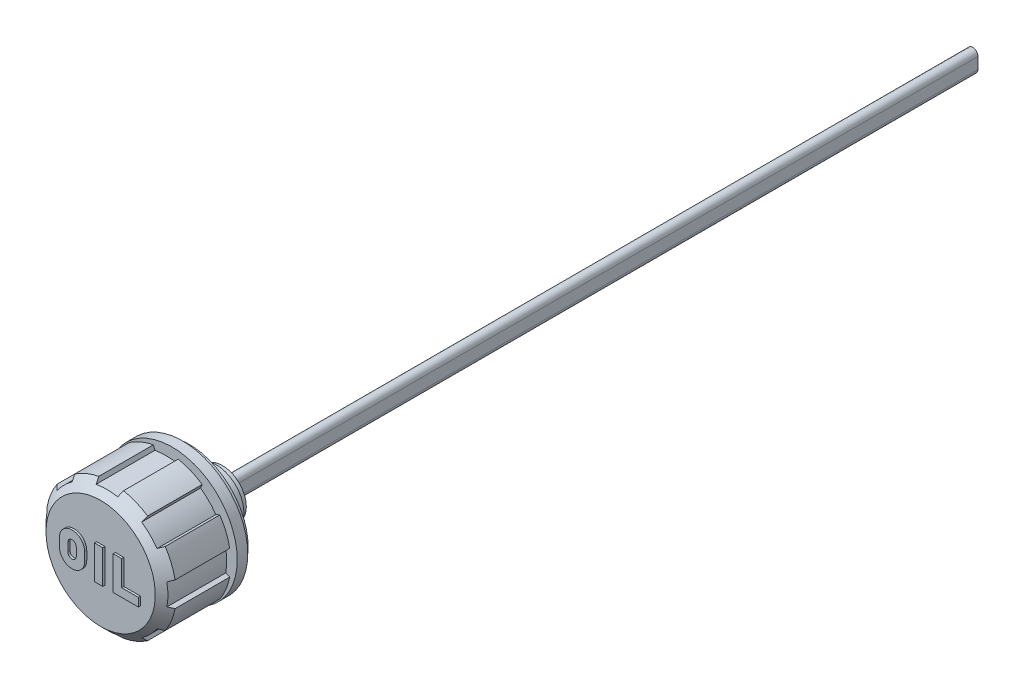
ISO-10303-21;
HEADER;
FILE_DESCRIPTION(('STEP AP214'),'2;1');
FILE_NAME('part.step','',(''),(''),'','','');
FILE_SCHEMA(('AUTOMOTIVE_DESIGN { 1 0 10303 214 1 1 1 1 }'));
ENDSEC;
DATA;
#1=APPLICATION_CONTEXT('core data for automotive mechanical design processes');
#2=APPLICATION_PROTOCOL_DEFINITION('international standard','automotive_design',2000,#1);
#3=PRODUCT_CONTEXT('',#1,'mechanical');
#4=PRODUCT('Part','Part','',(#3));
#5=PRODUCT_RELATED_PRODUCT_CATEGORY('part','',(#4));
#6=PRODUCT_DEFINITION_FORMATION('','',#4);
#7=PRODUCT_DEFINITION_CONTEXT('part definition',#1,'design');
#8=PRODUCT_DEFINITION('design','',#6,#7);
#9=PRODUCT_DEFINITION_SHAPE('','',#8);
#10=(LENGTH_UNIT() NAMED_UNIT(*) SI_UNIT(.MILLI.,.METRE.));
#11=(NAMED_UNIT(*) PLANE_ANGLE_UNIT() SI_UNIT($,.RADIAN.));
#12=(NAMED_UNIT(*) SI_UNIT($,.STERADIAN.) SOLID_ANGLE_UNIT());
#13=UNCERTAINTY_MEASURE_WITH_UNIT(LENGTH_MEASURE(1.E-05),#10,'distance_accuracy_value','');
#14=(GEOMETRIC_REPRESENTATION_CONTEXT(3) GLOBAL_UNCERTAINTY_ASSIGNED_CONTEXT((#13)) GLOBAL_UNIT_ASSIGNED_CONTEXT((#10,
#11,#12)) REPRESENTATION_CONTEXT('',''));
#15=CARTESIAN_POINT('',(0.,0.,0.));
#16=DIRECTION('',(0.,0.,1.));
#17=DIRECTION('',(1.,0.,0.));
#18=AXIS2_PLACEMENT_3D('',#15,#16,#17);
#19=CARTESIAN_POINT('',(0.,0.,4.75));
#20=DIRECTION('',(0.,0.,1.));
#21=DIRECTION('',(1.,0.,0.));
#22=AXIS2_PLACEMENT_3D('',#19,#20,#21);
#23=CYLINDRICAL_SURFACE('',#22,10.3333333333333);
#24=CARTESIAN_POINT('',(0.,0.,4.));
#25=DIRECTION('',(0.,0.,1.));
#26=DIRECTION('',(1.,0.,0.));
#27=AXIS2_PLACEMENT_3D('',#24,#25,#26);
#28=CIRCLE('',#27,10.3333333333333);
#29=CARTESIAN_POINT('',(10.3333333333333,0.,4.));
#30=VERTEX_POINT('',#29);
#31=EDGE_CURVE('E364',#30,#30,#28,.F.);
#32=ORIENTED_EDGE('',*,*,#31,.F.);
#33=EDGE_LOOP('',(#32));
#34=FACE_BOUND('',#33,.T.);
#35=CARTESIAN_POINT('',(0.,0.,5.5));
#36=DIRECTION('',(0.,0.,1.));
#37=DIRECTION('',(1.,0.,0.));
#38=AXIS2_PLACEMENT_3D('',#35,#36,#37);
#39=CIRCLE('',#38,10.3333333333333);
#40=CARTESIAN_POINT('',(10.3333333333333,0.,5.5));
#41=VERTEX_POINT('',#40);
#42=EDGE_CURVE('E17',#41,#41,#39,.F.);
#43=ORIENTED_EDGE('',*,*,#42,.T.);
#44=EDGE_LOOP('',(#43));
#45=FACE_BOUND('',#44,.T.);
#46=ADVANCED_FACE('F14',(#34,#45),#23,.T.);
#47=CARTESIAN_POINT('',(0.,12.9166666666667,4.));
#48=DIRECTION('',(0.,0.,1.));
#49=DIRECTION('',(1.,0.,0.));
#50=AXIS2_PLACEMENT_3D('',#47,#48,#49);
#51=PLANE('',#50);
#52=ORIENTED_EDGE('',*,*,#31,.T.);
#53=EDGE_LOOP('',(#52));
#54=FACE_BOUND('',#53,.T.);
#55=CARTESIAN_POINT('',(0.,0.,4.));
#56=DIRECTION('',(0.,0.,1.));
#57=DIRECTION('',(1.,0.,0.));
#58=AXIS2_PLACEMENT_3D('',#55,#56,#57);
#59=CIRCLE('',#58,15.5);
#60=CARTESIAN_POINT('',(15.5,0.,4.));
#61=VERTEX_POINT('',#60);
#62=EDGE_CURVE('E362',#61,#61,#59,.F.);
#63=ORIENTED_EDGE('',*,*,#62,.F.);
#64=EDGE_LOOP('',(#63));
#65=FACE_BOUND('',#64,.T.);
#66=ADVANCED_FACE('F451',(#54,#65),#51,.T.);
#67=CARTESIAN_POINT('',(0.,0.,2.75));
#68=DIRECTION('',(0.,0.,1.));
#69=DIRECTION('',(1.,0.,0.));
#70=AXIS2_PLACEMENT_3D('',#67,#68,#69);
#71=CYLINDRICAL_SURFACE('',#70,15.5);
#72=CARTESIAN_POINT('',(0.,0.,1.5));
#73=DIRECTION('',(0.,0.,1.));
#74=DIRECTION('',(1.,0.,0.));
#75=AXIS2_PLACEMENT_3D('',#72,#73,#74);
#76=CIRCLE('',#75,15.5);
#77=CARTESIAN_POINT('',(15.5,0.,1.5));
#78=VERTEX_POINT('',#77);
#79=EDGE_CURVE('E359',#78,#78,#76,.F.);
#80=ORIENTED_EDGE('',*,*,#79,.F.);
#81=EDGE_LOOP('',(#80));
#82=FACE_BOUND('',#81,.T.);
#83=ORIENTED_EDGE('',*,*,#62,.T.);
#84=EDGE_LOOP('',(#83));
#85=FACE_BOUND('',#84,.T.);
#86=ADVANCED_FACE('F448',(#82,#85),#71,.T.);
#87=CARTESIAN_POINT('',(0.,14.7954545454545,1.49999999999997));
#88=DIRECTION('',(0.,0.,-1.));
#89=DIRECTION('',(-1.,0.,0.));
#90=AXIS2_PLACEMENT_3D('',#87,#88,#89);
#91=PLANE('',#90);
#92=ORIENTED_EDGE('',*,*,#79,.T.);
#93=EDGE_LOOP('',(#92));
#94=FACE_BOUND('',#93,.T.);
#95=CARTESIAN_POINT('',(0.,0.,1.5));
#96=DIRECTION('',(0.,0.,1.));
#97=DIRECTION('',(1.,0.,0.));
#98=AXIS2_PLACEMENT_3D('',#95,#96,#97);
#99=CIRCLE('',#98,14.0909090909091);
#100=CARTESIAN_POINT('',(14.0909090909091,0.,1.5));
#101=VERTEX_POINT('',#100);
#102=EDGE_CURVE('E356',#101,#101,#99,.F.);
#103=ORIENTED_EDGE('',*,*,#102,.F.);
#104=EDGE_LOOP('',(#103));
#105=FACE_BOUND('',#104,.T.);
#106=ADVANCED_FACE('F444',(#94,#105),#91,.T.);
#107=CARTESIAN_POINT('',(0.,0.,0.75));
#108=DIRECTION('',(0.,0.,1.));
#109=DIRECTION('',(1.,0.,0.));
#110=AXIS2_PLACEMENT_3D('',#107,#108,#109);
#111=CYLINDRICAL_SURFACE('',#110,14.0909090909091);
#112=CARTESIAN_POINT('',(0.,0.,0.));
#113=DIRECTION('',(0.,0.,1.));
#114=DIRECTION('',(1.,0.,0.));
#115=AXIS2_PLACEMENT_3D('',#112,#113,#114);
#116=CIRCLE('',#115,14.0909090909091);
#117=CARTESIAN_POINT('',(14.0909090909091,0.,0.));
#118=VERTEX_POINT('',#117);
#119=EDGE_CURVE('E353',#118,#118,#116,.F.);
#120=ORIENTED_EDGE('',*,*,#119,.F.);
#121=EDGE_LOOP('',(#120));
#122=FACE_BOUND('',#121,.T.);
#123=ORIENTED_EDGE('',*,*,#102,.T.);
#124=EDGE_LOOP('',(#123));
#125=FACE_BOUND('',#124,.T.);
#126=ADVANCED_FACE('F440',(#122,#125),#111,.T.);
#127=CARTESIAN_POINT('',(0.,10.3354545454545,0.));
#128=DIRECTION('',(0.,0.,-1.));
#129=DIRECTION('',(-1.,0.,0.));
#130=AXIS2_PLACEMENT_3D('',#127,#128,#129);
#131=PLANE('',#130);
#132=ORIENTED_EDGE('',*,*,#119,.T.);
#133=EDGE_LOOP('',(#132));
#134=FACE_BOUND('',#133,.T.);
#135=CARTESIAN_POINT('',(0.,0.,0.));
#136=DIRECTION('',(0.,0.,1.));
#137=DIRECTION('',(1.,0.,0.));
#138=AXIS2_PLACEMENT_3D('',#135,#136,#137);
#139=CIRCLE('',#138,6.58);
#140=CARTESIAN_POINT('',(6.58,0.,0.));
#141=VERTEX_POINT('',#140);
#142=EDGE_CURVE('E350',#141,#141,#139,.F.);
#143=ORIENTED_EDGE('',*,*,#142,.F.);
#144=EDGE_LOOP('',(#143));
#145=FACE_BOUND('',#144,.T.);
#146=ADVANCED_FACE('F436',(#134,#145),#131,.T.);
#147=CARTESIAN_POINT('',(0.,0.,-3.25));
#148=DIRECTION('',(0.,0.,1.));
#149=DIRECTION('',(1.,0.,0.));
#150=AXIS2_PLACEMENT_3D('',#147,#148,#149);
#151=CYLINDRICAL_SURFACE('',#150,6.58);
#152=CARTESIAN_POINT('',(0.,0.,-6.5));
#153=DIRECTION('',(0.,0.,1.));
#154=DIRECTION('',(1.,0.,0.));
#155=AXIS2_PLACEMENT_3D('',#152,#153,#154);
#156=CIRCLE('',#155,6.58);
#157=CARTESIAN_POINT('',(6.58,0.,-6.5));
#158=VERTEX_POINT('',#157);
#159=EDGE_CURVE('E347',#158,#158,#156,.F.);
#160=ORIENTED_EDGE('',*,*,#159,.F.);
#161=EDGE_LOOP('',(#160));
#162=FACE_BOUND('',#161,.T.);
#163=ORIENTED_EDGE('',*,*,#142,.T.);
#164=EDGE_LOOP('',(#163));
#165=FACE_BOUND('',#164,.T.);
#166=ADVANCED_FACE('F432',(#162,#165),#151,.T.);
#167=CARTESIAN_POINT('',(0.,6.11992374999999,-6.5));
#168=DIRECTION('',(0.,0.,-1.));
#169=DIRECTION('',(-1.,0.,0.));
#170=AXIS2_PLACEMENT_3D('',#167,#168,#169);
#171=PLANE('',#170);
#172=ORIENTED_EDGE('',*,*,#159,.T.);
#173=EDGE_LOOP('',(#172));
#174=FACE_BOUND('',#173,.T.);
#175=CARTESIAN_POINT('',(0.,0.,-6.5));
#176=DIRECTION('',(0.,0.,1.));
#177=DIRECTION('',(1.,0.,0.));
#178=AXIS2_PLACEMENT_3D('',#175,#176,#177);
#179=CIRCLE('',#178,5.6598475);
#180=CARTESIAN_POINT('',(5.6598475,0.,-6.5));
#181=VERTEX_POINT('',#180);
#182=EDGE_CURVE('E344',#181,#181,#179,.F.);
#183=ORIENTED_EDGE('',*,*,#182,.F.);
#184=EDGE_LOOP('',(#183));
#185=FACE_BOUND('',#184,.T.);
#186=ADVANCED_FACE('F428',(#174,#185),#171,.T.);
#187=CARTESIAN_POINT('',(0.,0.,-7.25));
#188=DIRECTION('',(0.,0.,1.));
#189=DIRECTION('',(1.,0.,0.));
#190=AXIS2_PLACEMENT_3D('',#187,#188,#189);
#191=CYLINDRICAL_SURFACE('',#190,5.6598475);
#192=CARTESIAN_POINT('',(0.,0.,-8.));
#193=DIRECTION('',(0.,0.,1.));
#194=DIRECTION('',(1.,0.,0.));
#195=AXIS2_PLACEMENT_3D('',#192,#193,#194);
#196=CIRCLE('',#195,5.6598475);
#197=CARTESIAN_POINT('',(5.6598475,0.,-8.));
#198=VERTEX_POINT('',#197);
#199=EDGE_CURVE('E341',#198,#198,#196,.F.);
#200=ORIENTED_EDGE('',*,*,#199,.F.);
#201=EDGE_LOOP('',(#200));
#202=FACE_BOUND('',#201,.T.);
#203=ORIENTED_EDGE('',*,*,#182,.T.);
#204=EDGE_LOOP('',(#203));
#205=FACE_BOUND('',#204,.T.);
#206=ADVANCED_FACE('F424',(#202,#205),#191,.T.);
#207=CARTESIAN_POINT('',(0.,4.82992374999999,-8.));
#208=DIRECTION('',(0.,0.,-1.));
#209=DIRECTION('',(-1.,0.,0.));
#210=AXIS2_PLACEMENT_3D('',#207,#208,#209);
#211=PLANE('',#210);
#212=ORIENTED_EDGE('',*,*,#199,.T.);
#213=EDGE_LOOP('',(#212));
#214=FACE_BOUND('',#213,.T.);
#215=CARTESIAN_POINT('',(0.,0.,-8.));
#216=DIRECTION('',(0.,0.,1.));
#217=DIRECTION('',(1.,0.,0.));
#218=AXIS2_PLACEMENT_3D('',#215,#216,#217);
#219=CIRCLE('',#218,4.);
#220=CARTESIAN_POINT('',(4.,0.,-8.));
#221=VERTEX_POINT('',#220);
#222=EDGE_CURVE('E309',#221,#221,#219,.T.);
#223=ORIENTED_EDGE('',*,*,#222,.T.);
#224=EDGE_LOOP('',(#223));
#225=FACE_BOUND('',#224,.T.);
#226=ADVANCED_FACE('F420',(#214,#225),#211,.T.);
#227=CARTESIAN_POINT('',(0.,0.,-2.));
#228=DIRECTION('',(0.,0.,1.));
#229=DIRECTION('',(1.,0.,0.));
#230=AXIS2_PLACEMENT_3D('',#227,#228,#229);
#231=CYLINDRICAL_SURFACE('',#230,4.);
#232=CARTESIAN_POINT('',(0.,0.,4.));
#233=DIRECTION('',(0.,0.,1.));
#234=DIRECTION('',(1.,0.,0.));
#235=AXIS2_PLACEMENT_3D('',#232,#233,#234);
#236=CIRCLE('',#235,4.);
#237=CARTESIAN_POINT('',(4.,0.,4.));
#238=VERTEX_POINT('',#237);
#239=EDGE_CURVE('E308',#238,#238,#236,.F.);
#240=ORIENTED_EDGE('',*,*,#239,.F.);
#241=EDGE_LOOP('',(#240));
#242=FACE_BOUND('',#241,.T.);
#243=ORIENTED_EDGE('',*,*,#222,.F.);
#244=EDGE_LOOP('',(#243));
#245=FACE_BOUND('',#244,.T.);
#246=ADVANCED_FACE('F414',(#242,#245),#231,.F.);
#247=CARTESIAN_POINT('',(0.,2.,4.));
#248=DIRECTION('',(0.,0.,-1.));
#249=DIRECTION('',(-1.,0.,0.));
#250=AXIS2_PLACEMENT_3D('',#247,#248,#249);
#251=PLANE('',#250);
#252=ORIENTED_EDGE('',*,*,#239,.T.);
#253=EDGE_LOOP('',(#252));
#254=FACE_BOUND('',#253,.T.);
#255=CARTESIAN_POINT('',(0.,1.35,4.));
#256=DIRECTION('',(0.,0.,1.));
#257=DIRECTION('',(1.,0.,0.));
#258=AXIS2_PLACEMENT_3D('',#255,#256,#257);
#259=CIRCLE('',#258,1.25);
#260=CARTESIAN_POINT('',(1.25,1.35,4.));
#261=VERTEX_POINT('',#260);
#262=CARTESIAN_POINT('',(-1.25,1.35,4.));
#263=VERTEX_POINT('',#262);
#264=EDGE_CURVE('E298',#261,#263,#259,.T.);
#265=ORIENTED_EDGE('',*,*,#264,.T.);
#266=DIRECTION('',(0.,1.,0.));
#267=VECTOR('',#266,1.);
#268=CARTESIAN_POINT('',(-1.25,1.35,4.));
#269=LINE('',#268,#267);
#270=CARTESIAN_POINT('',(-1.25,-1.35,4.));
#271=VERTEX_POINT('',#270);
#272=EDGE_CURVE('E331',#271,#263,#269,.T.);
#273=ORIENTED_EDGE('',*,*,#272,.F.);
#274=CARTESIAN_POINT('',(0.,-1.35,4.));
#275=DIRECTION('',(0.,0.,1.));
#276=DIRECTION('',(1.,0.,0.));
#277=AXIS2_PLACEMENT_3D('',#274,#275,#276);
#278=CIRCLE('',#277,1.25);
#279=CARTESIAN_POINT('',(1.25,-1.35,4.));
#280=VERTEX_POINT('',#279);
#281=EDGE_CURVE('E315',#280,#271,#278,.F.);
#282=ORIENTED_EDGE('',*,*,#281,.F.);
#283=DIRECTION('',(0.,1.,0.));
#284=VECTOR('',#283,1.);
#285=CARTESIAN_POINT('',(1.25,-1.35,4.));
#286=LINE('',#285,#284);
#287=EDGE_CURVE('E312',#261,#280,#286,.F.);
#288=ORIENTED_EDGE('',*,*,#287,.F.);
#289=EDGE_LOOP('',(#265,#273,#282,#288));
#290=FACE_BOUND('',#289,.T.);
#291=ADVANCED_FACE('F313',(#254,#290),#251,.T.);
#292=CARTESIAN_POINT('',(0.,1.35000000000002,11.));
#293=DIRECTION('',(0.,0.,1.));
#294=DIRECTION('',(1.,0.,0.));
#295=AXIS2_PLACEMENT_3D('',#292,#293,#294);
#296=CYLINDRICAL_SURFACE('',#295,1.25);
#297=CARTESIAN_POINT('',(0.,1.3499999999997,-186.5));
#298=DIRECTION('',(0.,0.,1.));
#299=DIRECTION('',(1.,0.,0.));
#300=AXIS2_PLACEMENT_3D('',#297,#298,#299);
#301=CIRCLE('',#300,1.25);
#302=CARTESIAN_POINT('',(1.25,1.3499999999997,-186.5));
#303=VERTEX_POINT('',#302);
#304=CARTESIAN_POINT('',(-1.25,1.3499999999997,-186.5));
#305=VERTEX_POINT('',#304);
#306=EDGE_CURVE('E330',#303,#305,#301,.T.);
#307=ORIENTED_EDGE('',*,*,#306,.T.);
#308=DIRECTION('',(0.,0.,1.));
#309=VECTOR('',#308,1.);
#310=CARTESIAN_POINT('',(-1.25,1.35000000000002,11.));
#311=LINE('',#310,#309);
#312=EDGE_CURVE('E305',#263,#305,#311,.F.);
#313=ORIENTED_EDGE('',*,*,#312,.F.);
#314=ORIENTED_EDGE('',*,*,#264,.F.);
#315=DIRECTION('',(0.,0.,-1.));
#316=VECTOR('',#315,1.);
#317=CARTESIAN_POINT('',(1.25,1.35000000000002,11.));
#318=LINE('',#317,#316);
#319=EDGE_CURVE('E302',#303,#261,#318,.F.);
#320=ORIENTED_EDGE('',*,*,#319,.F.);
#321=EDGE_LOOP('',(#307,#313,#314,#320));
#322=FACE_BOUND('',#321,.T.);
#323=ADVANCED_FACE('F300',(#322),#296,.T.);
#324=CARTESIAN_POINT('',(-1.25,1.35000000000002,11.));
#325=DIRECTION('',(-1.,0.,0.));
#326=DIRECTION('',(0.,0.,1.));
#327=AXIS2_PLACEMENT_3D('',#324,#325,#326);
#328=PLANE('',#327);
#329=DIRECTION('',(0.,1.,0.));
#330=VECTOR('',#329,1.);
#331=CARTESIAN_POINT('',(-1.25,-2.98639318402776E-13,-186.5));
#332=LINE('',#331,#330);
#333=CARTESIAN_POINT('',(-1.25,-1.3500000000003,-186.5));
#334=VERTEX_POINT('',#333);
#335=EDGE_CURVE('E320',#305,#334,#332,.F.);
#336=ORIENTED_EDGE('',*,*,#335,.T.);
#337=DIRECTION('',(0.,0.,1.));
#338=VECTOR('',#337,1.);
#339=CARTESIAN_POINT('',(-1.25,-1.34999999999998,11.));
#340=LINE('',#339,#338);
#341=EDGE_CURVE('E324',#271,#334,#340,.F.);
#342=ORIENTED_EDGE('',*,*,#341,.F.);
#343=ORIENTED_EDGE('',*,*,#272,.T.);
#344=ORIENTED_EDGE('',*,*,#312,.T.);
#345=EDGE_LOOP('',(#336,#342,#343,#344));
#346=FACE_BOUND('',#345,.T.);
#347=ADVANCED_FACE('F388',(#346),#328,.T.);
#348=CARTESIAN_POINT('',(0.,-1.34999999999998,11.));
#349=DIRECTION('',(0.,0.,1.));
#350=DIRECTION('',(1.,0.,0.));
#351=AXIS2_PLACEMENT_3D('',#348,#349,#350);
#352=CYLINDRICAL_SURFACE('',#351,1.25);
#353=CARTESIAN_POINT('',(0.,-1.3500000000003,-186.5));
#354=DIRECTION('',(0.,0.,1.));
#355=DIRECTION('',(1.,0.,0.));
#356=AXIS2_PLACEMENT_3D('',#353,#354,#355);
#357=CIRCLE('',#356,1.25);
#358=CARTESIAN_POINT('',(1.25,-1.3500000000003,-186.5));
#359=VERTEX_POINT('',#358);
#360=EDGE_CURVE('E332',#334,#359,#357,.T.);
#361=ORIENTED_EDGE('',*,*,#360,.T.);
#362=DIRECTION('',(0.,0.,1.));
#363=VECTOR('',#362,1.);
#364=CARTESIAN_POINT('',(1.25,-1.34999999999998,11.));
#365=LINE('',#364,#363);
#366=EDGE_CURVE('E334',#359,#280,#365,.T.);
#367=ORIENTED_EDGE('',*,*,#366,.T.);
#368=ORIENTED_EDGE('',*,*,#281,.T.);
#369=ORIENTED_EDGE('',*,*,#341,.T.);
#370=EDGE_LOOP('',(#361,#367,#368,#369));
#371=FACE_BOUND('',#370,.T.);
#372=ADVANCED_FACE('F377',(#371),#352,.T.);
#373=CARTESIAN_POINT('',(1.25,-1.34999999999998,11.));
#374=DIRECTION('',(1.,0.,0.));
#375=DIRECTION('',(0.,0.,-1.));
#376=AXIS2_PLACEMENT_3D('',#373,#374,#375);
#377=PLANE('',#376);
#378=DIRECTION('',(0.,1.,0.));
#379=VECTOR('',#378,1.);
#380=CARTESIAN_POINT('',(1.25,-1.3500000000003,-186.5));
#381=LINE('',#380,#379);
#382=EDGE_CURVE('E319',#359,#303,#381,.T.);
#383=ORIENTED_EDGE('',*,*,#382,.T.);
#384=ORIENTED_EDGE('',*,*,#319,.T.);
#385=ORIENTED_EDGE('',*,*,#287,.T.);
#386=ORIENTED_EDGE('',*,*,#366,.F.);
#387=EDGE_LOOP('',(#383,#384,#385,#386));
#388=FACE_BOUND('',#387,.T.);
#389=ADVANCED_FACE('F322',(#388),#377,.T.);
#390=CARTESIAN_POINT('',(0.,-2.98639318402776E-13,-186.5));
#391=DIRECTION('',(0.,0.,1.));
#392=DIRECTION('',(1.,0.,0.));
#393=AXIS2_PLACEMENT_3D('',#390,#391,#392);
#394=PLANE('',#393);
#395=ORIENTED_EDGE('',*,*,#335,.F.);
#396=ORIENTED_EDGE('',*,*,#306,.F.);
#397=ORIENTED_EDGE('',*,*,#382,.F.);
#398=ORIENTED_EDGE('',*,*,#360,.F.);
#399=EDGE_LOOP('',(#395,#396,#397,#398));
#400=FACE_BOUND('',#399,.T.);
#401=ADVANCED_FACE('F375',(#400),#394,.F.);
#402=CARTESIAN_POINT('',(0.,14.95,5.5));
#403=DIRECTION('',(0.,0.,-1.));
#404=DIRECTION('',(-1.,0.,0.));
#405=AXIS2_PLACEMENT_3D('',#402,#403,#404);
#406=PLANE('',#405);
#407=DIRECTION('',(-0.927183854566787,0.374606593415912,0.));
#408=VECTOR('',#407,1.);
#409=CARTESIAN_POINT('',(-14.2694497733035,2.57542291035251,5.5));
#410=LINE('',#409,#408);
#411=CARTESIAN_POINT('',(-14.2694497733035,2.5754229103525,5.5));
#412=VERTEX_POINT('',#411);
#413=CARTESIAN_POINT('',(-15.2152213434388,2.95753942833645,5.5));
#414=VERTEX_POINT('',#413);
#415=EDGE_CURVE('E31',#412,#414,#410,.T.);
#416=ORIENTED_EDGE('',*,*,#415,.T.);
#417=CARTESIAN_POINT('',(0.,0.,5.5));
#418=DIRECTION('',(0.,0.,1.));
#419=DIRECTION('',(1.,0.,0.));
#420=AXIS2_PLACEMENT_3D('',#417,#418,#419);
#421=CIRCLE('',#420,15.5);
#422=CARTESIAN_POINT('',(-12.8500823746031,8.66749000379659,5.5));
#423=VERTEX_POINT('',#422);
#424=EDGE_CURVE('E9',#414,#423,#421,.F.);
#425=ORIENTED_EDGE('',*,*,#424,.T.);
#426=DIRECTION('',(0.92050485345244,-0.390731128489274,0.));
#427=VECTOR('',#426,1.);
#428=CARTESIAN_POINT('',(-12.8500823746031,8.66749000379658,5.5));
#429=LINE('',#428,#427);
#430=CARTESIAN_POINT('',(-11.9111237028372,8.26892569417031,5.5));
#431=VERTEX_POINT('',#430);
#432=EDGE_CURVE('E1346',#423,#431,#429,.T.);
#433=ORIENTED_EDGE('',*,*,#432,.T.);
#434=CARTESIAN_POINT('',(0.,0.,5.5));
#435=DIRECTION('',(0.,0.,1.));
#436=DIRECTION('',(1.,0.,0.));
#437=AXIS2_PLACEMENT_3D('',#434,#435,#436);
#438=CIRCLE('',#437,14.5);
#439=CARTESIAN_POINT('',(-8.26892569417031,11.9111237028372,5.5));
#440=VERTEX_POINT('',#439);
#441=EDGE_CURVE('E1194',#431,#440,#438,.F.);
#442=ORIENTED_EDGE('',*,*,#441,.T.);
#443=DIRECTION('',(-0.390731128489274,0.92050485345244,0.));
#444=VECTOR('',#443,1.);
#445=CARTESIAN_POINT('',(-8.26892569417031,11.9111237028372,5.5));
#446=LINE('',#445,#444);
#447=CARTESIAN_POINT('',(-8.66749000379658,12.8500823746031,5.5));
#448=VERTEX_POINT('',#447);
#449=EDGE_CURVE('E1426',#440,#448,#446,.T.);
#450=ORIENTED_EDGE('',*,*,#449,.T.);
#451=CARTESIAN_POINT('',(0.,0.,5.5));
#452=DIRECTION('',(0.,0.,1.));
#453=DIRECTION('',(1.,0.,0.));
#454=AXIS2_PLACEMENT_3D('',#451,#452,#453);
#455=CIRCLE('',#454,15.5);
#456=CARTESIAN_POINT('',(-2.95753942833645,15.2152213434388,5.5));
#457=VERTEX_POINT('',#456);
#458=EDGE_CURVE('E1191',#448,#457,#455,.F.);
#459=ORIENTED_EDGE('',*,*,#458,.T.);
#460=DIRECTION('',(0.374606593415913,-0.927183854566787,0.));
#461=VECTOR('',#460,1.);
#462=CARTESIAN_POINT('',(-2.95753942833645,15.2152213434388,5.5));
#463=LINE('',#462,#461);
#464=CARTESIAN_POINT('',(-2.5754229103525,14.2694497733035,5.5));
#465=VERTEX_POINT('',#464);
#466=EDGE_CURVE('E1419',#457,#465,#463,.T.);
#467=ORIENTED_EDGE('',*,*,#466,.T.);
#468=CARTESIAN_POINT('',(0.,0.,5.5));
#469=DIRECTION('',(0.,0.,1.));
#470=DIRECTION('',(1.,0.,0.));
#471=AXIS2_PLACEMENT_3D('',#468,#469,#470);
#472=CIRCLE('',#471,14.5);
#473=CARTESIAN_POINT('',(2.5754229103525,14.2694497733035,5.5));
#474=VERTEX_POINT('',#473);
#475=EDGE_CURVE('E1188',#465,#474,#472,.F.);
#476=ORIENTED_EDGE('',*,*,#475,.T.);
#477=DIRECTION('',(0.374606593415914,0.927183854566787,0.));
#478=VECTOR('',#477,1.);
#479=CARTESIAN_POINT('',(2.5754229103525,14.2694497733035,5.5));
#480=LINE('',#479,#478);
#481=CARTESIAN_POINT('',(2.95753942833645,15.2152213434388,5.5));
#482=VERTEX_POINT('',#481);
#483=EDGE_CURVE('E1412',#474,#482,#480,.T.);
#484=ORIENTED_EDGE('',*,*,#483,.T.);
#485=CARTESIAN_POINT('',(0.,0.,5.5));
#486=DIRECTION('',(0.,0.,1.));
#487=DIRECTION('',(1.,0.,0.));
#488=AXIS2_PLACEMENT_3D('',#485,#486,#487);
#489=CIRCLE('',#488,15.5);
#490=CARTESIAN_POINT('',(8.6674900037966,12.8500823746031,5.5));
#491=VERTEX_POINT('',#490);
#492=EDGE_CURVE('E1185',#482,#491,#489,.F.);
#493=ORIENTED_EDGE('',*,*,#492,.T.);
#494=DIRECTION('',(-0.390731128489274,-0.92050485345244,0.));
#495=VECTOR('',#494,1.);
#496=CARTESIAN_POINT('',(8.66749000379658,12.8500823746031,5.5));
#497=LINE('',#496,#495);
#498=CARTESIAN_POINT('',(8.26892569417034,11.9111237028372,5.5));
#499=VERTEX_POINT('',#498);
#500=EDGE_CURVE('E1405',#491,#499,#497,.T.);
#501=ORIENTED_EDGE('',*,*,#500,.T.);
#502=CARTESIAN_POINT('',(0.,0.,5.5));
#503=DIRECTION('',(0.,0.,1.));
#504=DIRECTION('',(1.,0.,0.));
#505=AXIS2_PLACEMENT_3D('',#502,#503,#504);
#506=CIRCLE('',#505,14.5);
#507=CARTESIAN_POINT('',(11.9111237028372,8.26892569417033,5.5));
#508=VERTEX_POINT('',#507);
#509=EDGE_CURVE('E1182',#499,#508,#506,.F.);
#510=ORIENTED_EDGE('',*,*,#509,.T.);
#511=DIRECTION('',(0.92050485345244,0.390731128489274,0.));
#512=VECTOR('',#511,1.);
#513=CARTESIAN_POINT('',(11.9111237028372,8.26892569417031,5.5));
#514=LINE('',#513,#512);
#515=CARTESIAN_POINT('',(12.8500823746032,8.66749000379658,5.5));
#516=VERTEX_POINT('',#515);
#517=EDGE_CURVE('E1398',#508,#516,#514,.T.);
#518=ORIENTED_EDGE('',*,*,#517,.T.);
#519=CARTESIAN_POINT('',(0.,0.,5.5));
#520=DIRECTION('',(0.,0.,1.));
#521=DIRECTION('',(1.,0.,0.));
#522=AXIS2_PLACEMENT_3D('',#519,#520,#521);
#523=CIRCLE('',#522,15.5);
#524=CARTESIAN_POINT('',(15.2152213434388,2.95753942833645,5.5));
#525=VERTEX_POINT('',#524);
#526=EDGE_CURVE('E1179',#516,#525,#523,.F.);
#527=ORIENTED_EDGE('',*,*,#526,.T.);
#528=DIRECTION('',(-0.927183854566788,-0.374606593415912,0.));
#529=VECTOR('',#528,1.);
#530=CARTESIAN_POINT('',(15.2152213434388,2.95753942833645,5.5));
#531=LINE('',#530,#529);
#532=CARTESIAN_POINT('',(14.2694497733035,2.57542291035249,5.5));
#533=VERTEX_POINT('',#532);
#534=EDGE_CURVE('E1391',#525,#533,#531,.T.);
#535=ORIENTED_EDGE('',*,*,#534,.T.);
#536=CARTESIAN_POINT('',(0.,0.,5.5));
#537=DIRECTION('',(0.,0.,1.));
#538=DIRECTION('',(1.,0.,0.));
#539=AXIS2_PLACEMENT_3D('',#536,#537,#538);
#540=CIRCLE('',#539,14.5);
#541=CARTESIAN_POINT('',(14.2694497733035,-2.57542291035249,5.5));
#542=VERTEX_POINT('',#541);
#543=EDGE_CURVE('E1176',#533,#542,#540,.F.);
#544=ORIENTED_EDGE('',*,*,#543,.T.);
#545=DIRECTION('',(0.927183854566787,-0.374606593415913,0.));
#546=VECTOR('',#545,1.);
#547=CARTESIAN_POINT('',(14.2694497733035,-2.5754229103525,5.5));
#548=LINE('',#547,#546);
#549=CARTESIAN_POINT('',(15.2152213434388,-2.95753942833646,5.5));
#550=VERTEX_POINT('',#549);
#551=EDGE_CURVE('E1384',#542,#550,#548,.T.);
#552=ORIENTED_EDGE('',*,*,#551,.T.);
#553=CARTESIAN_POINT('',(0.,0.,5.5));
#554=DIRECTION('',(0.,0.,1.));
#555=DIRECTION('',(1.,0.,0.));
#556=AXIS2_PLACEMENT_3D('',#553,#554,#555);
#557=CIRCLE('',#556,15.5);
#558=CARTESIAN_POINT('',(12.8500823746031,-8.6674900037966,5.5));
#559=VERTEX_POINT('',#558);
#560=EDGE_CURVE('E1173',#550,#559,#557,.F.);
#561=ORIENTED_EDGE('',*,*,#560,.T.);
#562=DIRECTION('',(-0.92050485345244,0.390731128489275,0.));
#563=VECTOR('',#562,1.);
#564=CARTESIAN_POINT('',(12.8500823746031,-8.66749000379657,5.5));
#565=LINE('',#564,#563);
#566=CARTESIAN_POINT('',(11.9111237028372,-8.26892569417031,5.5));
#567=VERTEX_POINT('',#566);
#568=EDGE_CURVE('E1377',#559,#567,#565,.T.);
#569=ORIENTED_EDGE('',*,*,#568,.T.);
#570=CARTESIAN_POINT('',(0.,0.,5.5));
#571=DIRECTION('',(0.,0.,1.));
#572=DIRECTION('',(1.,0.,0.));
#573=AXIS2_PLACEMENT_3D('',#570,#571,#572);
#574=CIRCLE('',#573,14.5);
#575=CARTESIAN_POINT('',(8.26892569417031,-11.9111237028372,5.5));
#576=VERTEX_POINT('',#575);
#577=EDGE_CURVE('E1170',#567,#576,#574,.F.);
#578=ORIENTED_EDGE('',*,*,#577,.T.);
#579=DIRECTION('',(0.390731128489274,-0.92050485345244,0.));
#580=VECTOR('',#579,1.);
#581=CARTESIAN_POINT('',(8.2689256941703,-11.9111237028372,5.5));
#582=LINE('',#581,#580);
#583=CARTESIAN_POINT('',(8.66749000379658,-12.8500823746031,5.5));
#584=VERTEX_POINT('',#583);
#585=EDGE_CURVE('E1371',#576,#584,#582,.T.);
#586=ORIENTED_EDGE('',*,*,#585,.T.);
#587=CARTESIAN_POINT('',(0.,0.,5.5));
#588=DIRECTION('',(0.,0.,1.));
#589=DIRECTION('',(1.,0.,0.));
#590=AXIS2_PLACEMENT_3D('',#587,#588,#589);
#591=CIRCLE('',#590,15.5);
#592=CARTESIAN_POINT('',(2.95753942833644,-15.2152213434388,5.5));
#593=VERTEX_POINT('',#592);
#594=EDGE_CURVE('E1167',#584,#593,#591,.F.);
#595=ORIENTED_EDGE('',*,*,#594,.T.);
#596=DIRECTION('',(-0.374606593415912,0.927183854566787,0.));
#597=VECTOR('',#596,1.);
#598=CARTESIAN_POINT('',(2.95753942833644,-15.2152213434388,5.5));
#599=LINE('',#598,#597);
#600=CARTESIAN_POINT('',(2.57542291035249,-14.2694497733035,5.5));
#601=VERTEX_POINT('',#600);
#602=EDGE_CURVE('E1369',#593,#601,#599,.T.);
#603=ORIENTED_EDGE('',*,*,#602,.T.);
#604=CARTESIAN_POINT('',(0.,0.,5.5));
#605=DIRECTION('',(0.,0.,1.));
#606=DIRECTION('',(1.,0.,0.));
#607=AXIS2_PLACEMENT_3D('',#604,#605,#606);
#608=CIRCLE('',#607,14.5);
#609=CARTESIAN_POINT('',(-2.57542291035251,-14.2694497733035,5.5));
#610=VERTEX_POINT('',#609);
#611=EDGE_CURVE('E1164',#601,#610,#608,.F.);
#612=ORIENTED_EDGE('',*,*,#611,.T.);
#613=DIRECTION('',(-0.374606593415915,-0.927183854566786,0.));
#614=VECTOR('',#613,1.);
#615=CARTESIAN_POINT('',(-2.5754229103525,-14.2694497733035,5.5));
#616=LINE('',#615,#614);
#617=CARTESIAN_POINT('',(-2.95753942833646,-15.2152213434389,5.5));
#618=VERTEX_POINT('',#617);
#619=EDGE_CURVE('E1357',#610,#618,#616,.T.);
#620=ORIENTED_EDGE('',*,*,#619,.T.);
#621=CARTESIAN_POINT('',(0.,-1.15537921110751E-13,5.5));
#622=DIRECTION('',(0.,0.,1.));
#623=DIRECTION('',(1.,0.,0.));
#624=AXIS2_PLACEMENT_3D('',#621,#622,#623);
#625=CIRCLE('',#624,15.5);
#626=CARTESIAN_POINT('',(-8.66749000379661,-12.8500823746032,5.5));
#627=VERTEX_POINT('',#626);
#628=EDGE_CURVE('E1161',#618,#627,#625,.F.);
#629=ORIENTED_EDGE('',*,*,#628,.T.);
#630=DIRECTION('',(0.390731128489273,0.920504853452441,0.));
#631=VECTOR('',#630,1.);
#632=CARTESIAN_POINT('',(-8.66749000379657,-12.8500823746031,5.5));
#633=LINE('',#632,#631);
#634=CARTESIAN_POINT('',(-8.2689256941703,-11.9111237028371,5.5));
#635=VERTEX_POINT('',#634);
#636=EDGE_CURVE('E1342',#627,#635,#633,.T.);
#637=ORIENTED_EDGE('',*,*,#636,.T.);
#638=CARTESIAN_POINT('',(-1.01252339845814E-13,-1.22643348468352E-13,5.5));
#639=DIRECTION('',(0.,0.,1.));
#640=DIRECTION('',(1.,0.,0.));
#641=AXIS2_PLACEMENT_3D('',#638,#639,#640);
#642=CIRCLE('',#641,14.4999999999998);
#643=CARTESIAN_POINT('',(-11.9111237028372,-8.26892569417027,5.5));
#644=VERTEX_POINT('',#643);
#645=EDGE_CURVE('E1158',#635,#644,#642,.F.);
#646=ORIENTED_EDGE('',*,*,#645,.T.);
#647=DIRECTION('',(-0.920504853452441,-0.390731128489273,0.));
#648=VECTOR('',#647,1.);
#649=CARTESIAN_POINT('',(-11.9111237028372,-8.26892569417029,5.5));
#650=LINE('',#649,#648);
#651=CARTESIAN_POINT('',(-12.8500823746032,-8.66749000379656,5.5));
#652=VERTEX_POINT('',#651);
#653=EDGE_CURVE('E1322',#644,#652,#650,.T.);
#654=ORIENTED_EDGE('',*,*,#653,.T.);
#655=CARTESIAN_POINT('',(0.,0.,5.5));
#656=DIRECTION('',(0.,0.,1.));
#657=DIRECTION('',(1.,0.,0.));
#658=AXIS2_PLACEMENT_3D('',#655,#656,#657);
#659=CIRCLE('',#658,15.5);
#660=CARTESIAN_POINT('',(-15.2152213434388,-2.95753942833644,5.5));
#661=VERTEX_POINT('',#660);
#662=EDGE_CURVE('E1155',#652,#661,#659,.F.);
#663=ORIENTED_EDGE('',*,*,#662,.T.);
#664=DIRECTION('',(0.927183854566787,0.374606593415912,0.));
#665=VECTOR('',#664,1.);
#666=CARTESIAN_POINT('',(-15.2152213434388,-2.95753942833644,5.5));
#667=LINE('',#666,#665);
#668=CARTESIAN_POINT('',(-14.2694497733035,-2.57542291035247,5.5));
#669=VERTEX_POINT('',#668);
#670=EDGE_CURVE('E1318',#661,#669,#667,.T.);
#671=ORIENTED_EDGE('',*,*,#670,.T.);
#672=CARTESIAN_POINT('',(0.,0.,5.5));
#673=DIRECTION('',(0.,0.,1.));
#674=DIRECTION('',(1.,0.,0.));
#675=AXIS2_PLACEMENT_3D('',#672,#673,#674);
#676=CIRCLE('',#675,14.5);
#677=EDGE_CURVE('E23',#669,#412,#676,.F.);
#678=ORIENTED_EDGE('',*,*,#677,.T.);
#679=EDGE_LOOP('',(#416,#425,#433,#442,#450,#459,#467,#476,#484,#493,#501,#510,#518,#527,#535,
#544,#552,#561,#569,#578,#586,#595,#603,#612,#620,#629,#637,#646,#654,#663,#671,#678));
#680=FACE_BOUND('',#679,.T.);
#681=ORIENTED_EDGE('',*,*,#42,.F.);
#682=EDGE_LOOP('',(#681));
#683=FACE_BOUND('',#682,.T.);
#684=ADVANCED_FACE('F372',(#680,#683),#406,.T.);
#685=CARTESIAN_POINT('',(-14.2694497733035,2.57542291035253,21.5));
#686=DIRECTION('',(0.374606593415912,0.927183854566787,0.));
#687=DIRECTION('',(-0.927183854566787,0.374606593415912,0.));
#688=AXIS2_PLACEMENT_3D('',#685,#686,#687);
#689=PLANE('',#688);
#690=DIRECTION('',(0.,0.,1.));
#691=VECTOR('',#690,1.);
#692=CARTESIAN_POINT('',(-15.2152213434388,2.95753942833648,21.5));
#693=LINE('',#692,#691);
#694=CARTESIAN_POINT('',(-15.2152213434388,2.95753942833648,18.5));
#695=VERTEX_POINT('',#694);
#696=EDGE_CURVE('E1197',#414,#695,#693,.T.);
#697=ORIENTED_EDGE('',*,*,#696,.F.);
#698=ORIENTED_EDGE('',*,*,#415,.F.);
#699=DIRECTION('',(0.,0.,1.));
#700=VECTOR('',#699,1.);
#701=CARTESIAN_POINT('',(-14.2694497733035,2.57542291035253,21.5));
#702=LINE('',#701,#700);
#703=CARTESIAN_POINT('',(-14.2694497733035,2.57542291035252,19.5));
#704=VERTEX_POINT('',#703);
#705=EDGE_CURVE('E1349',#704,#412,#702,.F.);
#706=ORIENTED_EDGE('',*,*,#705,.F.);
#707=CARTESIAN_POINT('',(-15.2152213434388,2.95753942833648,18.5));
#708=CARTESIAN_POINT('',(-15.0576970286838,2.89389547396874,18.6667813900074));
#709=CARTESIAN_POINT('',(-14.9001205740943,2.83023045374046,18.8335054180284));
#710=CARTESIAN_POINT('',(-14.58486338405,2.70285828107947,19.1668387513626));
#711=CARTESIAN_POINT('',(-14.4271826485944,2.63915112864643,19.3334480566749));
#712=CARTESIAN_POINT('',(-14.2694497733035,2.57542291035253,19.5));
#713=B_SPLINE_CURVE_WITH_KNOTS('',3,(#707,#708,#709,#710,#711,#712),.UNSPECIFIED.,.F.,.F.,(4,2,
4),(0.,0.714229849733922,1.42845970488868),.UNSPECIFIED.);
#714=EDGE_CURVE('E1198',#695,#704,#713,.T.);
#715=ORIENTED_EDGE('',*,*,#714,.F.);
#716=EDGE_LOOP('',(#697,#698,#706,#715));
#717=FACE_BOUND('',#716,.T.);
#718=ADVANCED_FACE('F374',(#717),#689,.F.);
#719=CARTESIAN_POINT('',(0.,0.,21.5));
#720=DIRECTION('',(0.,0.,1.));
#721=DIRECTION('',(1.,0.,0.));
#722=AXIS2_PLACEMENT_3D('',#719,#720,#721);
#723=CYLINDRICAL_SURFACE('',#722,15.5);
#724=ORIENTED_EDGE('',*,*,#424,.F.);
#725=ORIENTED_EDGE('',*,*,#696,.T.);
#726=CARTESIAN_POINT('',(0.,0.,18.5));
#727=DIRECTION('',(0.,0.,1.));
#728=DIRECTION('',(1.,0.,0.));
#729=AXIS2_PLACEMENT_3D('',#726,#727,#728);
#730=CIRCLE('',#729,15.5);
#731=CARTESIAN_POINT('',(-12.8500823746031,8.66749000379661,18.5));
#732=VERTEX_POINT('',#731);
#733=EDGE_CURVE('E1651',#695,#732,#730,.F.);
#734=ORIENTED_EDGE('',*,*,#733,.T.);
#735=DIRECTION('',(0.,0.,1.));
#736=VECTOR('',#735,1.);
#737=CARTESIAN_POINT('',(-12.8500823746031,8.66749000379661,21.5));
#738=LINE('',#737,#736);
#739=EDGE_CURVE('E1652',#732,#423,#738,.F.);
#740=ORIENTED_EDGE('',*,*,#739,.T.);
#741=EDGE_LOOP('',(#724,#725,#734,#740));
#742=FACE_BOUND('',#741,.T.);
#743=ADVANCED_FACE('F383',(#742),#723,.T.);
#744=CARTESIAN_POINT('',(-12.8500823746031,8.66749000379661,21.5));
#745=DIRECTION('',(-0.390731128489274,-0.92050485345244,0.));
#746=DIRECTION('',(0.92050485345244,-0.390731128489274,0.));
#747=AXIS2_PLACEMENT_3D('',#744,#745,#746);
#748=PLANE('',#747);
#749=DIRECTION('',(0.,0.,1.));
#750=VECTOR('',#749,1.);
#751=CARTESIAN_POINT('',(-11.9111237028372,8.26892569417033,21.5));
#752=LINE('',#751,#750);
#753=CARTESIAN_POINT('',(-11.9111237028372,8.26892569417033,19.5));
#754=VERTEX_POINT('',#753);
#755=EDGE_CURVE('E1436',#431,#754,#752,.T.);
#756=ORIENTED_EDGE('',*,*,#755,.F.);
#757=ORIENTED_EDGE('',*,*,#432,.F.);
#758=ORIENTED_EDGE('',*,*,#739,.F.);
#759=CARTESIAN_POINT('',(-11.9111237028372,8.26892569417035,19.5));
#760=CARTESIAN_POINT('',(-12.06772034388,8.33539702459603,19.3334480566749));
#761=CARTESIAN_POINT('',(-12.2242652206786,8.40184638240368,19.1668387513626));
#762=CARTESIAN_POINT('',(-12.5372514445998,8.53470115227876,18.8335054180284));
#763=CARTESIAN_POINT('',(-12.6936927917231,8.60110656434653,18.6667813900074));
#764=CARTESIAN_POINT('',(-12.8500823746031,8.66749000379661,18.5));
#765=B_SPLINE_CURVE_WITH_KNOTS('',3,(#759,#760,#761,#762,#763,#764),.UNSPECIFIED.,.F.,.F.,(4,2,
4),(0.,0.714229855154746,1.42845970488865),.UNSPECIFIED.);
#766=EDGE_CURVE('E1206',#754,#732,#765,.T.);
#767=ORIENTED_EDGE('',*,*,#766,.F.);
#768=EDGE_LOOP('',(#756,#757,#758,#767));
#769=FACE_BOUND('',#768,.T.);
#770=ADVANCED_FACE('F584',(#769),#748,.F.);
#771=CARTESIAN_POINT('',(0.,0.,21.5));
#772=DIRECTION('',(0.,0.,1.));
#773=DIRECTION('',(1.,0.,0.));
#774=AXIS2_PLACEMENT_3D('',#771,#772,#773);
#775=CYLINDRICAL_SURFACE('',#774,14.5);
#776=ORIENTED_EDGE('',*,*,#441,.F.);
#777=ORIENTED_EDGE('',*,*,#755,.T.);
#778=CARTESIAN_POINT('',(0.,0.,19.5));
#779=DIRECTION('',(0.,0.,1.));
#780=DIRECTION('',(1.,0.,0.));
#781=AXIS2_PLACEMENT_3D('',#778,#779,#780);
#782=CIRCLE('',#781,14.5);
#783=CARTESIAN_POINT('',(-8.26892569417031,11.9111237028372,19.5));
#784=VERTEX_POINT('',#783);
#785=EDGE_CURVE('E1205',#754,#784,#782,.F.);
#786=ORIENTED_EDGE('',*,*,#785,.T.);
#787=DIRECTION('',(0.,0.,1.));
#788=VECTOR('',#787,1.);
#789=CARTESIAN_POINT('',(-8.26892569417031,11.9111237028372,21.5));
#790=LINE('',#789,#788);
#791=EDGE_CURVE('E1438',#784,#440,#790,.F.);
#792=ORIENTED_EDGE('',*,*,#791,.T.);
#793=EDGE_LOOP('',(#776,#777,#786,#792));
#794=FACE_BOUND('',#793,.T.);
#795=ADVANCED_FACE('F593',(#794),#775,.T.);
#796=CARTESIAN_POINT('',(-8.26892569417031,11.9111237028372,21.5));
#797=DIRECTION('',(0.92050485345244,0.390731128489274,0.));
#798=DIRECTION('',(-0.390731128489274,0.92050485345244,0.));
#799=AXIS2_PLACEMENT_3D('',#796,#797,#798);
#800=PLANE('',#799);
#801=DIRECTION('',(0.,0.,1.));
#802=VECTOR('',#801,1.);
#803=CARTESIAN_POINT('',(-8.66749000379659,12.8500823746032,21.5));
#804=LINE('',#803,#802);
#805=CARTESIAN_POINT('',(-8.66749000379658,12.8500823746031,18.5));
#806=VERTEX_POINT('',#805);
#807=EDGE_CURVE('E1648',#448,#806,#804,.T.);
#808=ORIENTED_EDGE('',*,*,#807,.F.);
#809=ORIENTED_EDGE('',*,*,#449,.F.);
#810=ORIENTED_EDGE('',*,*,#791,.F.);
#811=CARTESIAN_POINT('',(-8.66749000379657,12.8500823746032,18.5));
#812=CARTESIAN_POINT('',(-8.60110656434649,12.6936927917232,18.6667813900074));
#813=CARTESIAN_POINT('',(-8.53470115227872,12.5372514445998,18.8335054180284));
#814=CARTESIAN_POINT('',(-8.40184638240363,12.2242652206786,19.1668387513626));
#815=CARTESIAN_POINT('',(-8.33539702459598,12.06772034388,19.3334480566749));
#816=CARTESIAN_POINT('',(-8.26892569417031,11.9111237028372,19.5));
#817=B_SPLINE_CURVE_WITH_KNOTS('',3,(#811,#812,#813,#814,#815,#816),.UNSPECIFIED.,.F.,.F.,(4,2,
4),(0.,0.714229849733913,1.42845970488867),.UNSPECIFIED.);
#818=EDGE_CURVE('E1219',#806,#784,#817,.T.);
#819=ORIENTED_EDGE('',*,*,#818,.F.);
#820=EDGE_LOOP('',(#808,#809,#810,#819));
#821=FACE_BOUND('',#820,.T.);
#822=ADVANCED_FACE('F603',(#821),#800,.F.);
#823=CARTESIAN_POINT('',(0.,0.,21.5));
#824=DIRECTION('',(0.,0.,1.));
#825=DIRECTION('',(1.,0.,0.));
#826=AXIS2_PLACEMENT_3D('',#823,#824,#825);
#827=CYLINDRICAL_SURFACE('',#826,15.5);
#828=ORIENTED_EDGE('',*,*,#458,.F.);
#829=ORIENTED_EDGE('',*,*,#807,.T.);
#830=CARTESIAN_POINT('',(0.,0.,18.5));
#831=DIRECTION('',(0.,0.,1.));
#832=DIRECTION('',(1.,0.,0.));
#833=AXIS2_PLACEMENT_3D('',#830,#831,#832);
#834=CIRCLE('',#833,15.5);
#835=CARTESIAN_POINT('',(-2.95753942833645,15.2152213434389,18.5));
#836=VERTEX_POINT('',#835);
#837=EDGE_CURVE('E1433',#806,#836,#834,.F.);
#838=ORIENTED_EDGE('',*,*,#837,.T.);
#839=DIRECTION('',(0.,0.,1.));
#840=VECTOR('',#839,1.);
#841=CARTESIAN_POINT('',(-2.95753942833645,15.2152213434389,21.5));
#842=LINE('',#841,#840);
#843=EDGE_CURVE('E1435',#836,#457,#842,.F.);
#844=ORIENTED_EDGE('',*,*,#843,.T.);
#845=EDGE_LOOP('',(#828,#829,#838,#844));
#846=FACE_BOUND('',#845,.T.);
#847=ADVANCED_FACE('F613',(#846),#827,.T.);
#848=CARTESIAN_POINT('',(-2.95753942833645,15.2152213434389,21.5));
#849=DIRECTION('',(-0.927183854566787,-0.374606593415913,0.));
#850=DIRECTION('',(0.374606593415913,-0.927183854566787,0.));
#851=AXIS2_PLACEMENT_3D('',#848,#849,#850);
#852=PLANE('',#851);
#853=DIRECTION('',(0.,0.,1.));
#854=VECTOR('',#853,1.);
#855=CARTESIAN_POINT('',(-2.5754229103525,14.2694497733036,21.5));
#856=LINE('',#855,#854);
#857=CARTESIAN_POINT('',(-2.5754229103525,14.2694497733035,19.5));
#858=VERTEX_POINT('',#857);
#859=EDGE_CURVE('E1428',#465,#858,#856,.T.);
#860=ORIENTED_EDGE('',*,*,#859,.F.);
#861=ORIENTED_EDGE('',*,*,#466,.F.);
#862=ORIENTED_EDGE('',*,*,#843,.F.);
#863=CARTESIAN_POINT('',(-2.57542291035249,14.2694497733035,19.5));
#864=CARTESIAN_POINT('',(-2.63915112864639,14.4271826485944,19.3334480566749));
#865=CARTESIAN_POINT('',(-2.70285828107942,14.58486338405,19.1668387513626));
#866=CARTESIAN_POINT('',(-2.83023045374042,14.9001205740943,18.8335054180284));
#867=CARTESIAN_POINT('',(-2.8938954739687,15.0576970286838,18.6667813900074));
#868=CARTESIAN_POINT('',(-2.95753942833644,15.2152213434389,18.5));
#869=B_SPLINE_CURVE_WITH_KNOTS('',3,(#863,#864,#865,#866,#867,#868),.UNSPECIFIED.,.F.,.F.,(4,2,
4),(0.,0.714229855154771,1.4284597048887),.UNSPECIFIED.);
#870=EDGE_CURVE('E1314',#858,#836,#869,.T.);
#871=ORIENTED_EDGE('',*,*,#870,.F.);
#872=EDGE_LOOP('',(#860,#861,#862,#871));
#873=FACE_BOUND('',#872,.T.);
#874=ADVANCED_FACE('F623',(#873),#852,.F.);
#875=CARTESIAN_POINT('',(0.,0.,21.5));
#876=DIRECTION('',(0.,0.,1.));
#877=DIRECTION('',(1.,0.,0.));
#878=AXIS2_PLACEMENT_3D('',#875,#876,#877);
#879=CYLINDRICAL_SURFACE('',#878,14.5);
#880=ORIENTED_EDGE('',*,*,#859,.T.);
#881=CARTESIAN_POINT('',(0.,0.,19.5));
#882=DIRECTION('',(0.,0.,1.));
#883=DIRECTION('',(1.,0.,0.));
#884=AXIS2_PLACEMENT_3D('',#881,#882,#883);
#885=CIRCLE('',#884,14.5);
#886=CARTESIAN_POINT('',(2.5754229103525,14.2694497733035,19.5));
#887=VERTEX_POINT('',#886);
#888=EDGE_CURVE('E1424',#858,#887,#885,.F.);
#889=ORIENTED_EDGE('',*,*,#888,.T.);
#890=DIRECTION('',(0.,0.,1.));
#891=VECTOR('',#890,1.);
#892=CARTESIAN_POINT('',(2.5754229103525,14.2694497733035,21.5));
#893=LINE('',#892,#891);
#894=EDGE_CURVE('E1711',#887,#474,#893,.F.);
#895=ORIENTED_EDGE('',*,*,#894,.T.);
#896=ORIENTED_EDGE('',*,*,#475,.F.);
#897=EDGE_LOOP('',(#880,#889,#895,#896));
#898=FACE_BOUND('',#897,.T.);
#899=ADVANCED_FACE('F633',(#898),#879,.T.);
#900=CARTESIAN_POINT('',(2.5754229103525,14.2694497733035,21.5));
#901=DIRECTION('',(0.927183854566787,-0.374606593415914,0.));
#902=DIRECTION('',(0.374606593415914,0.927183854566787,0.));
#903=AXIS2_PLACEMENT_3D('',#900,#901,#902);
#904=PLANE('',#903);
#905=DIRECTION('',(0.,0.,1.));
#906=VECTOR('',#905,1.);
#907=CARTESIAN_POINT('',(2.95753942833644,15.2152213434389,21.5));
#908=LINE('',#907,#906);
#909=CARTESIAN_POINT('',(2.95753942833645,15.2152213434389,18.5));
#910=VERTEX_POINT('',#909);
#911=EDGE_CURVE('E1417',#482,#910,#908,.T.);
#912=ORIENTED_EDGE('',*,*,#911,.F.);
#913=ORIENTED_EDGE('',*,*,#483,.F.);
#914=ORIENTED_EDGE('',*,*,#894,.F.);
#915=CARTESIAN_POINT('',(2.95753942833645,15.2152213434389,18.5));
#916=CARTESIAN_POINT('',(2.89389547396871,15.0576970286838,18.6667813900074));
#917=CARTESIAN_POINT('',(2.83023045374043,14.9001205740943,18.8335054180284));
#918=CARTESIAN_POINT('',(2.70285828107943,14.58486338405,19.1668387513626));
#919=CARTESIAN_POINT('',(2.63915112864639,14.4271826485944,19.3334480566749));
#920=CARTESIAN_POINT('',(2.5754229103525,14.2694497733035,19.5));
#921=B_SPLINE_CURVE_WITH_KNOTS('',3,(#915,#916,#917,#918,#919,#920),.UNSPECIFIED.,.F.,.F.,(4,2,
4),(0.,0.714229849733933,1.4284597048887),.UNSPECIFIED.);
#922=EDGE_CURVE('E1229',#910,#887,#921,.T.);
#923=ORIENTED_EDGE('',*,*,#922,.F.);
#924=EDGE_LOOP('',(#912,#913,#914,#923));
#925=FACE_BOUND('',#924,.T.);
#926=ADVANCED_FACE('F643',(#925),#904,.F.);
#927=CARTESIAN_POINT('',(0.,0.,21.5));
#928=DIRECTION('',(0.,0.,1.));
#929=DIRECTION('',(1.,0.,0.));
#930=AXIS2_PLACEMENT_3D('',#927,#928,#929);
#931=CYLINDRICAL_SURFACE('',#930,15.5);
#932=ORIENTED_EDGE('',*,*,#492,.F.);
#933=ORIENTED_EDGE('',*,*,#911,.T.);
#934=CARTESIAN_POINT('',(0.,0.,18.5));
#935=DIRECTION('',(0.,0.,1.));
#936=DIRECTION('',(1.,0.,0.));
#937=AXIS2_PLACEMENT_3D('',#934,#935,#936);
#938=CIRCLE('',#937,15.5);
#939=CARTESIAN_POINT('',(8.6674900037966,12.8500823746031,18.5));
#940=VERTEX_POINT('',#939);
#941=EDGE_CURVE('E1420',#910,#940,#938,.F.);
#942=ORIENTED_EDGE('',*,*,#941,.T.);
#943=DIRECTION('',(0.,0.,1.));
#944=VECTOR('',#943,1.);
#945=CARTESIAN_POINT('',(8.6674900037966,12.8500823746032,21.5));
#946=LINE('',#945,#944);
#947=EDGE_CURVE('E1423',#940,#491,#946,.F.);
#948=ORIENTED_EDGE('',*,*,#947,.T.);
#949=EDGE_LOOP('',(#932,#933,#942,#948));
#950=FACE_BOUND('',#949,.T.);
#951=ADVANCED_FACE('F653',(#950),#931,.T.);
#952=CARTESIAN_POINT('',(8.66749000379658,12.8500823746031,21.5));
#953=DIRECTION('',(-0.92050485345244,0.390731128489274,0.));
#954=DIRECTION('',(-0.390731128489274,-0.92050485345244,0.));
#955=AXIS2_PLACEMENT_3D('',#952,#953,#954);
#956=PLANE('',#955);
#957=DIRECTION('',(0.,0.,1.));
#958=VECTOR('',#957,1.);
#959=CARTESIAN_POINT('',(8.26892569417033,11.9111237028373,21.5));
#960=LINE('',#959,#958);
#961=CARTESIAN_POINT('',(8.26892569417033,11.9111237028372,19.5));
#962=VERTEX_POINT('',#961);
#963=EDGE_CURVE('E1410',#499,#962,#960,.T.);
#964=ORIENTED_EDGE('',*,*,#963,.F.);
#965=ORIENTED_EDGE('',*,*,#500,.F.);
#966=ORIENTED_EDGE('',*,*,#947,.F.);
#967=CARTESIAN_POINT('',(8.26892569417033,11.9111237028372,19.5));
#968=CARTESIAN_POINT('',(8.335397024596,12.06772034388,19.3334480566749));
#969=CARTESIAN_POINT('',(8.40184638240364,12.2242652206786,19.1668387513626));
#970=CARTESIAN_POINT('',(8.53470115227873,12.5372514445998,18.8335054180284));
#971=CARTESIAN_POINT('',(8.6011065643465,12.6936927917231,18.6667813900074));
#972=CARTESIAN_POINT('',(8.66749000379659,12.8500823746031,18.5));
#973=B_SPLINE_CURVE_WITH_KNOTS('',3,(#967,#968,#969,#970,#971,#972),.UNSPECIFIED.,.F.,.F.,(4,2,
4),(0.,0.714229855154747,1.42845970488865),.UNSPECIFIED.);
#974=EDGE_CURVE('E1236',#962,#940,#973,.T.);
#975=ORIENTED_EDGE('',*,*,#974,.F.);
#976=EDGE_LOOP('',(#964,#965,#966,#975));
#977=FACE_BOUND('',#976,.T.);
#978=ADVANCED_FACE('F663',(#977),#956,.F.);
#979=CARTESIAN_POINT('',(0.,0.,21.5));
#980=DIRECTION('',(0.,0.,1.));
#981=DIRECTION('',(1.,0.,0.));
#982=AXIS2_PLACEMENT_3D('',#979,#980,#981);
#983=CYLINDRICAL_SURFACE('',#982,14.5);
#984=ORIENTED_EDGE('',*,*,#509,.F.);
#985=ORIENTED_EDGE('',*,*,#963,.T.);
#986=CARTESIAN_POINT('',(0.,0.,19.5));
#987=DIRECTION('',(0.,0.,1.));
#988=DIRECTION('',(1.,0.,0.));
#989=AXIS2_PLACEMENT_3D('',#986,#987,#988);
#990=CIRCLE('',#989,14.5);
#991=CARTESIAN_POINT('',(11.9111237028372,8.26892569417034,19.5));
#992=VERTEX_POINT('',#991);
#993=EDGE_CURVE('E1413',#962,#992,#990,.F.);
#994=ORIENTED_EDGE('',*,*,#993,.T.);
#995=DIRECTION('',(0.,0.,1.));
#996=VECTOR('',#995,1.);
#997=CARTESIAN_POINT('',(11.9111237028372,8.26892569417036,21.5));
#998=LINE('',#997,#996);
#999=EDGE_CURVE('E1416',#992,#508,#998,.F.);
#1000=ORIENTED_EDGE('',*,*,#999,.T.);
#1001=EDGE_LOOP('',(#984,#985,#994,#1000));
#1002=FACE_BOUND('',#1001,.T.);
#1003=ADVANCED_FACE('F673',(#1002),#983,.T.);
#1004=CARTESIAN_POINT('',(11.9111237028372,8.26892569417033,21.5));
#1005=DIRECTION('',(0.390731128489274,-0.92050485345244,0.));
#1006=DIRECTION('',(0.92050485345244,0.390731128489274,0.));
#1007=AXIS2_PLACEMENT_3D('',#1004,#1005,#1006);
#1008=PLANE('',#1007);
#1009=DIRECTION('',(0.,0.,1.));
#1010=VECTOR('',#1009,1.);
#1011=CARTESIAN_POINT('',(12.8500823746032,8.6674900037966,21.5));
#1012=LINE('',#1011,#1010);
#1013=CARTESIAN_POINT('',(12.8500823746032,8.6674900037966,18.5));
#1014=VERTEX_POINT('',#1013);
#1015=EDGE_CURVE('E1403',#516,#1014,#1012,.T.);
#1016=ORIENTED_EDGE('',*,*,#1015,.F.);
#1017=ORIENTED_EDGE('',*,*,#517,.F.);
#1018=ORIENTED_EDGE('',*,*,#999,.F.);
#1019=CARTESIAN_POINT('',(12.8500823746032,8.6674900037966,18.5));
#1020=CARTESIAN_POINT('',(12.6936927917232,8.60110656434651,18.6667813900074));
#1021=CARTESIAN_POINT('',(12.5372514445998,8.53470115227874,18.8335054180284));
#1022=CARTESIAN_POINT('',(12.2242652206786,8.40184638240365,19.1668387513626));
#1023=CARTESIAN_POINT('',(12.06772034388,8.335397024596,19.3334480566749));
#1024=CARTESIAN_POINT('',(11.9111237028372,8.26892569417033,19.5));
#1025=B_SPLINE_CURVE_WITH_KNOTS('',3,(#1019,#1020,#1021,#1022,#1023,#1024),.UNSPECIFIED.,.F.,
.F.,(4,2,4),(0.,0.714229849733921,1.42845970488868),.UNSPECIFIED.);
#1026=EDGE_CURVE('E1243',#1014,#992,#1025,.T.);
#1027=ORIENTED_EDGE('',*,*,#1026,.F.);
#1028=EDGE_LOOP('',(#1016,#1017,#1018,#1027));
#1029=FACE_BOUND('',#1028,.T.);
#1030=ADVANCED_FACE('F683',(#1029),#1008,.F.);
#1031=CARTESIAN_POINT('',(0.,0.,21.5));
#1032=DIRECTION('',(0.,0.,1.));
#1033=DIRECTION('',(1.,0.,0.));
#1034=AXIS2_PLACEMENT_3D('',#1031,#1032,#1033);
#1035=CYLINDRICAL_SURFACE('',#1034,15.5);
#1036=ORIENTED_EDGE('',*,*,#526,.F.);
#1037=ORIENTED_EDGE('',*,*,#1015,.T.);
#1038=CARTESIAN_POINT('',(0.,0.,18.5));
#1039=DIRECTION('',(0.,0.,1.));
#1040=DIRECTION('',(1.,0.,0.));
#1041=AXIS2_PLACEMENT_3D('',#1038,#1039,#1040);
#1042=CIRCLE('',#1041,15.5);
#1043=CARTESIAN_POINT('',(15.2152213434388,2.95753942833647,18.5));
#1044=VERTEX_POINT('',#1043);
#1045=EDGE_CURVE('E1406',#1014,#1044,#1042,.F.);
#1046=ORIENTED_EDGE('',*,*,#1045,.T.);
#1047=DIRECTION('',(0.,0.,1.));
#1048=VECTOR('',#1047,1.);
#1049=CARTESIAN_POINT('',(15.2152213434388,2.95753942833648,21.5));
#1050=LINE('',#1049,#1048);
#1051=EDGE_CURVE('E1409',#1044,#525,#1050,.F.);
#1052=ORIENTED_EDGE('',*,*,#1051,.T.);
#1053=EDGE_LOOP('',(#1036,#1037,#1046,#1052));
#1054=FACE_BOUND('',#1053,.T.);
#1055=ADVANCED_FACE('F693',(#1054),#1035,.T.);
#1056=CARTESIAN_POINT('',(15.2152213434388,2.95753942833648,21.5));
#1057=DIRECTION('',(-0.374606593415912,0.927183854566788,0.));
#1058=DIRECTION('',(-0.927183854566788,-0.374606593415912,0.));
#1059=AXIS2_PLACEMENT_3D('',#1056,#1057,#1058);
#1060=PLANE('',#1059);
#1061=DIRECTION('',(0.,0.,1.));
#1062=VECTOR('',#1061,1.);
#1063=CARTESIAN_POINT('',(14.2694497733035,2.57542291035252,21.5));
#1064=LINE('',#1063,#1062);
#1065=CARTESIAN_POINT('',(14.2694497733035,2.57542291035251,19.5));
#1066=VERTEX_POINT('',#1065);
#1067=EDGE_CURVE('E1396',#533,#1066,#1064,.T.);
#1068=ORIENTED_EDGE('',*,*,#1067,.F.);
#1069=ORIENTED_EDGE('',*,*,#534,.F.);
#1070=ORIENTED_EDGE('',*,*,#1051,.F.);
#1071=CARTESIAN_POINT('',(14.2694497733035,2.57542291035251,19.5));
#1072=CARTESIAN_POINT('',(14.4271826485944,2.63915112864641,19.3334480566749));
#1073=CARTESIAN_POINT('',(14.58486338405,2.70285828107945,19.1668387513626));
#1074=CARTESIAN_POINT('',(14.9001205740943,2.83023045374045,18.8335054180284));
#1075=CARTESIAN_POINT('',(15.0576970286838,2.89389547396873,18.6667813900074));
#1076=CARTESIAN_POINT('',(15.2152213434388,2.95753942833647,18.5));
#1077=B_SPLINE_CURVE_WITH_KNOTS('',3,(#1071,#1072,#1073,#1074,#1075,#1076),.UNSPECIFIED.,.F.,
.F.,(4,2,4),(0.,0.714229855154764,1.42845970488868),.UNSPECIFIED.);
#1078=EDGE_CURVE('E1250',#1066,#1044,#1077,.T.);
#1079=ORIENTED_EDGE('',*,*,#1078,.F.);
#1080=EDGE_LOOP('',(#1068,#1069,#1070,#1079));
#1081=FACE_BOUND('',#1080,.T.);
#1082=ADVANCED_FACE('F703',(#1081),#1060,.F.);
#1083=CARTESIAN_POINT('',(0.,0.,21.5));
#1084=DIRECTION('',(0.,0.,1.));
#1085=DIRECTION('',(1.,0.,0.));
#1086=AXIS2_PLACEMENT_3D('',#1083,#1084,#1085);
#1087=CYLINDRICAL_SURFACE('',#1086,14.5);
#1088=ORIENTED_EDGE('',*,*,#543,.F.);
#1089=ORIENTED_EDGE('',*,*,#1067,.T.);
#1090=CARTESIAN_POINT('',(0.,0.,19.5));
#1091=DIRECTION('',(0.,0.,1.));
#1092=DIRECTION('',(1.,0.,0.));
#1093=AXIS2_PLACEMENT_3D('',#1090,#1091,#1092);
#1094=CIRCLE('',#1093,14.5);
#1095=CARTESIAN_POINT('',(14.2694497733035,-2.57542291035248,19.5));
#1096=VERTEX_POINT('',#1095);
#1097=EDGE_CURVE('E1399',#1066,#1096,#1094,.F.);
#1098=ORIENTED_EDGE('',*,*,#1097,.T.);
#1099=DIRECTION('',(0.,0.,1.));
#1100=VECTOR('',#1099,1.);
#1101=CARTESIAN_POINT('',(14.2694497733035,-2.57542291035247,21.5));
#1102=LINE('',#1101,#1100);
#1103=EDGE_CURVE('E1402',#1096,#542,#1102,.F.);
#1104=ORIENTED_EDGE('',*,*,#1103,.T.);
#1105=EDGE_LOOP('',(#1088,#1089,#1098,#1104));
#1106=FACE_BOUND('',#1105,.T.);
#1107=ADVANCED_FACE('F713',(#1106),#1087,.T.);
#1108=CARTESIAN_POINT('',(14.2694497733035,-2.57542291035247,21.5));
#1109=DIRECTION('',(-0.374606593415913,-0.927183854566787,0.));
#1110=DIRECTION('',(0.927183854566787,-0.374606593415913,0.));
#1111=AXIS2_PLACEMENT_3D('',#1108,#1109,#1110);
#1112=PLANE('',#1111);
#1113=DIRECTION('',(0.,0.,1.));
#1114=VECTOR('',#1113,1.);
#1115=CARTESIAN_POINT('',(15.2152213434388,-2.95753942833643,21.5));
#1116=LINE('',#1115,#1114);
#1117=CARTESIAN_POINT('',(15.2152213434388,-2.95753942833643,18.5));
#1118=VERTEX_POINT('',#1117);
#1119=EDGE_CURVE('E1389',#550,#1118,#1116,.T.);
#1120=ORIENTED_EDGE('',*,*,#1119,.F.);
#1121=ORIENTED_EDGE('',*,*,#551,.F.);
#1122=ORIENTED_EDGE('',*,*,#1103,.F.);
#1123=CARTESIAN_POINT('',(15.2152213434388,-2.95753942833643,18.5));
#1124=CARTESIAN_POINT('',(15.0576970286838,-2.89389547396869,18.6667813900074));
#1125=CARTESIAN_POINT('',(14.9001205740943,-2.83023045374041,18.8335054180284));
#1126=CARTESIAN_POINT('',(14.58486338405,-2.70285828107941,19.1668387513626));
#1127=CARTESIAN_POINT('',(14.4271826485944,-2.63915112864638,19.3334480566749));
#1128=CARTESIAN_POINT('',(14.2694497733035,-2.57542291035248,19.5));
#1129=B_SPLINE_CURVE_WITH_KNOTS('',3,(#1123,#1124,#1125,#1126,#1127,#1128),.UNSPECIFIED.,.F.,
.F.,(4,2,4),(0.,0.714229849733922,1.42845970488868),.UNSPECIFIED.);
#1130=EDGE_CURVE('E1257',#1118,#1096,#1129,.T.);
#1131=ORIENTED_EDGE('',*,*,#1130,.F.);
#1132=EDGE_LOOP('',(#1120,#1121,#1122,#1131));
#1133=FACE_BOUND('',#1132,.T.);
#1134=ADVANCED_FACE('F723',(#1133),#1112,.F.);
#1135=CARTESIAN_POINT('',(0.,0.,21.5));
#1136=DIRECTION('',(0.,0.,1.));
#1137=DIRECTION('',(1.,0.,0.));
#1138=AXIS2_PLACEMENT_3D('',#1135,#1136,#1137);
#1139=CYLINDRICAL_SURFACE('',#1138,15.5);
#1140=ORIENTED_EDGE('',*,*,#560,.F.);
#1141=ORIENTED_EDGE('',*,*,#1119,.T.);
#1142=CARTESIAN_POINT('',(0.,0.,18.5));
#1143=DIRECTION('',(0.,0.,1.));
#1144=DIRECTION('',(1.,0.,0.));
#1145=AXIS2_PLACEMENT_3D('',#1142,#1143,#1144);
#1146=CIRCLE('',#1145,15.5);
#1147=CARTESIAN_POINT('',(12.8500823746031,-8.66749000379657,18.5));
#1148=VERTEX_POINT('',#1147);
#1149=EDGE_CURVE('E1392',#1118,#1148,#1146,.F.);
#1150=ORIENTED_EDGE('',*,*,#1149,.T.);
#1151=DIRECTION('',(0.,0.,1.));
#1152=VECTOR('',#1151,1.);
#1153=CARTESIAN_POINT('',(12.8500823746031,-8.66749000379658,21.5));
#1154=LINE('',#1153,#1152);
#1155=EDGE_CURVE('E1395',#1148,#559,#1154,.F.);
#1156=ORIENTED_EDGE('',*,*,#1155,.T.);
#1157=EDGE_LOOP('',(#1140,#1141,#1150,#1156));
#1158=FACE_BOUND('',#1157,.T.);
#1159=ADVANCED_FACE('F733',(#1158),#1139,.T.);
#1160=CARTESIAN_POINT('',(12.8500823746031,-8.66749000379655,21.5));
#1161=DIRECTION('',(0.390731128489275,0.92050485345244,0.));
#1162=DIRECTION('',(-0.92050485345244,0.390731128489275,0.));
#1163=AXIS2_PLACEMENT_3D('',#1160,#1161,#1162);
#1164=PLANE('',#1163);
#1165=DIRECTION('',(0.,0.,1.));
#1166=VECTOR('',#1165,1.);
#1167=CARTESIAN_POINT('',(11.9111237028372,-8.26892569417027,21.5));
#1168=LINE('',#1167,#1166);
#1169=CARTESIAN_POINT('',(11.9111237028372,-8.26892569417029,19.5));
#1170=VERTEX_POINT('',#1169);
#1171=EDGE_CURVE('E1382',#567,#1170,#1168,.T.);
#1172=ORIENTED_EDGE('',*,*,#1171,.F.);
#1173=ORIENTED_EDGE('',*,*,#568,.F.);
#1174=ORIENTED_EDGE('',*,*,#1155,.F.);
#1175=CARTESIAN_POINT('',(11.9111237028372,-8.2689256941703,19.5));
#1176=CARTESIAN_POINT('',(12.06772034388,-8.33539702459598,19.3334480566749));
#1177=CARTESIAN_POINT('',(12.2242652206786,-8.40184638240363,19.1668387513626));
#1178=CARTESIAN_POINT('',(12.5372514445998,-8.53470115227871,18.8335054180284));
#1179=CARTESIAN_POINT('',(12.6936927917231,-8.60110656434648,18.6667813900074));
#1180=CARTESIAN_POINT('',(12.8500823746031,-8.66749000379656,18.5));
#1181=B_SPLINE_CURVE_WITH_KNOTS('',3,(#1175,#1176,#1177,#1178,#1179,#1180),.UNSPECIFIED.,.F.,
.F.,(4,2,4),(0.,0.714229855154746,1.42845970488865),.UNSPECIFIED.);
#1182=EDGE_CURVE('E1264',#1170,#1148,#1181,.T.);
#1183=ORIENTED_EDGE('',*,*,#1182,.F.);
#1184=EDGE_LOOP('',(#1172,#1173,#1174,#1183));
#1185=FACE_BOUND('',#1184,.T.);
#1186=ADVANCED_FACE('F743',(#1185),#1164,.F.);
#1187=CARTESIAN_POINT('',(0.,0.,21.5));
#1188=DIRECTION('',(0.,0.,1.));
#1189=DIRECTION('',(1.,0.,0.));
#1190=AXIS2_PLACEMENT_3D('',#1187,#1188,#1189);
#1191=CYLINDRICAL_SURFACE('',#1190,14.5);
#1192=ORIENTED_EDGE('',*,*,#577,.F.);
#1193=ORIENTED_EDGE('',*,*,#1171,.T.);
#1194=CARTESIAN_POINT('',(0.,0.,19.5));
#1195=DIRECTION('',(0.,0.,1.));
#1196=DIRECTION('',(1.,0.,0.));
#1197=AXIS2_PLACEMENT_3D('',#1194,#1195,#1196);
#1198=CIRCLE('',#1197,14.5);
#1199=CARTESIAN_POINT('',(8.2689256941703,-11.9111237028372,19.5));
#1200=VERTEX_POINT('',#1199);
#1201=EDGE_CURVE('E1385',#1170,#1200,#1198,.F.);
#1202=ORIENTED_EDGE('',*,*,#1201,.T.);
#1203=DIRECTION('',(0.,0.,1.));
#1204=VECTOR('',#1203,1.);
#1205=CARTESIAN_POINT('',(8.26892569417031,-11.9111237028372,21.5));
#1206=LINE('',#1205,#1204);
#1207=EDGE_CURVE('E1388',#1200,#576,#1206,.F.);
#1208=ORIENTED_EDGE('',*,*,#1207,.T.);
#1209=EDGE_LOOP('',(#1192,#1193,#1202,#1208));
#1210=FACE_BOUND('',#1209,.T.);
#1211=ADVANCED_FACE('F753',(#1210),#1191,.T.);
#1212=CARTESIAN_POINT('',(8.2689256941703,-11.9111237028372,21.5));
#1213=DIRECTION('',(-0.92050485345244,-0.390731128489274,0.));
#1214=DIRECTION('',(0.390731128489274,-0.92050485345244,0.));
#1215=AXIS2_PLACEMENT_3D('',#1212,#1213,#1214);
#1216=PLANE('',#1215);
#1217=DIRECTION('',(0.,0.,1.));
#1218=VECTOR('',#1217,1.);
#1219=CARTESIAN_POINT('',(8.66749000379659,-12.8500823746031,21.5));
#1220=LINE('',#1219,#1218);
#1221=CARTESIAN_POINT('',(8.66749000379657,-12.8500823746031,18.5));
#1222=VERTEX_POINT('',#1221);
#1223=EDGE_CURVE('E1681',#584,#1222,#1220,.T.);
#1224=ORIENTED_EDGE('',*,*,#1223,.F.);
#1225=ORIENTED_EDGE('',*,*,#585,.F.);
#1226=ORIENTED_EDGE('',*,*,#1207,.F.);
#1227=CARTESIAN_POINT('',(8.66749000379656,-12.8500823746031,18.5));
#1228=CARTESIAN_POINT('',(8.60110656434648,-12.6936927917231,18.6667813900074));
#1229=CARTESIAN_POINT('',(8.53470115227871,-12.5372514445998,18.8335054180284));
#1230=CARTESIAN_POINT('',(8.40184638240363,-12.2242652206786,19.1668387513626));
#1231=CARTESIAN_POINT('',(8.33539702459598,-12.0677203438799,19.333448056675));
#1232=CARTESIAN_POINT('',(8.2689256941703,-11.9111237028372,19.5));
#1233=B_SPLINE_CURVE_WITH_KNOTS('',3,(#1227,#1228,#1229,#1230,#1231,#1232),.UNSPECIFIED.,.F.,
.F.,(4,2,4),(0.,0.714229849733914,1.42845970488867),.UNSPECIFIED.);
#1234=EDGE_CURVE('E1271',#1222,#1200,#1233,.T.);
#1235=ORIENTED_EDGE('',*,*,#1234,.F.);
#1236=EDGE_LOOP('',(#1224,#1225,#1226,#1235));
#1237=FACE_BOUND('',#1236,.T.);
#1238=ADVANCED_FACE('F763',(#1237),#1216,.F.);
#1239=CARTESIAN_POINT('',(0.,0.,21.5));
#1240=DIRECTION('',(0.,0.,1.));
#1241=DIRECTION('',(1.,0.,0.));
#1242=AXIS2_PLACEMENT_3D('',#1239,#1240,#1241);
#1243=CYLINDRICAL_SURFACE('',#1242,15.5);
#1244=ORIENTED_EDGE('',*,*,#594,.F.);
#1245=ORIENTED_EDGE('',*,*,#1223,.T.);
#1246=CARTESIAN_POINT('',(0.,0.,18.5));
#1247=DIRECTION('',(0.,0.,1.));
#1248=DIRECTION('',(1.,0.,0.));
#1249=AXIS2_PLACEMENT_3D('',#1246,#1247,#1248);
#1250=CIRCLE('',#1249,15.5);
#1251=CARTESIAN_POINT('',(2.95753942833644,-15.2152213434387,18.5));
#1252=VERTEX_POINT('',#1251);
#1253=EDGE_CURVE('E1378',#1222,#1252,#1250,.F.);
#1254=ORIENTED_EDGE('',*,*,#1253,.T.);
#1255=DIRECTION('',(0.,0.,1.));
#1256=VECTOR('',#1255,1.);
#1257=CARTESIAN_POINT('',(2.95753942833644,-15.2152213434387,21.5));
#1258=LINE('',#1257,#1256);
#1259=EDGE_CURVE('E1381',#1252,#593,#1258,.F.);
#1260=ORIENTED_EDGE('',*,*,#1259,.T.);
#1261=EDGE_LOOP('',(#1244,#1245,#1254,#1260));
#1262=FACE_BOUND('',#1261,.T.);
#1263=ADVANCED_FACE('F773',(#1262),#1243,.T.);
#1264=CARTESIAN_POINT('',(2.95753942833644,-15.2152213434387,21.5));
#1265=DIRECTION('',(0.927183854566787,0.374606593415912,0.));
#1266=DIRECTION('',(-0.374606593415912,0.927183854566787,0.));
#1267=AXIS2_PLACEMENT_3D('',#1264,#1265,#1266);
#1268=PLANE('',#1267);
#1269=DIRECTION('',(0.,0.,1.));
#1270=VECTOR('',#1269,1.);
#1271=CARTESIAN_POINT('',(2.57542291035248,-14.2694497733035,21.5));
#1272=LINE('',#1271,#1270);
#1273=CARTESIAN_POINT('',(2.57542291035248,-14.2694497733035,19.5));
#1274=VERTEX_POINT('',#1273);
#1275=EDGE_CURVE('E1373',#601,#1274,#1272,.T.);
#1276=ORIENTED_EDGE('',*,*,#1275,.F.);
#1277=ORIENTED_EDGE('',*,*,#602,.F.);
#1278=ORIENTED_EDGE('',*,*,#1259,.F.);
#1279=CARTESIAN_POINT('',(2.57542291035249,-14.2694497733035,19.5));
#1280=CARTESIAN_POINT('',(2.63915112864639,-14.4271826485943,19.333448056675));
#1281=CARTESIAN_POINT('',(2.70285828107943,-14.5848633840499,19.1668387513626));
#1282=CARTESIAN_POINT('',(2.83023045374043,-14.9001205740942,18.8335054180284));
#1283=CARTESIAN_POINT('',(2.8938954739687,-15.0576970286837,18.6667813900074));
#1284=CARTESIAN_POINT('',(2.95753942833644,-15.2152213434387,18.5));
#1285=B_SPLINE_CURVE_WITH_KNOTS('',3,(#1279,#1280,#1281,#1282,#1283,#1284),.UNSPECIFIED.,.F.,
.F.,(4,2,4),(0.,0.714229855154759,1.42845970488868),.UNSPECIFIED.);
#1286=EDGE_CURVE('E1278',#1274,#1252,#1285,.T.);
#1287=ORIENTED_EDGE('',*,*,#1286,.F.);
#1288=EDGE_LOOP('',(#1276,#1277,#1278,#1287));
#1289=FACE_BOUND('',#1288,.T.);
#1290=ADVANCED_FACE('F783',(#1289),#1268,.F.);
#1291=CARTESIAN_POINT('',(0.,0.,21.5));
#1292=DIRECTION('',(0.,0.,1.));
#1293=DIRECTION('',(1.,0.,0.));
#1294=AXIS2_PLACEMENT_3D('',#1291,#1292,#1293);
#1295=CYLINDRICAL_SURFACE('',#1294,14.5);
#1296=ORIENTED_EDGE('',*,*,#1275,.T.);
#1297=CARTESIAN_POINT('',(0.,0.,19.5));
#1298=DIRECTION('',(0.,0.,1.));
#1299=DIRECTION('',(1.,0.,0.));
#1300=AXIS2_PLACEMENT_3D('',#1297,#1298,#1299);
#1301=CIRCLE('',#1300,14.5);
#1302=CARTESIAN_POINT('',(-2.5754229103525,-14.2694497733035,19.5));
#1303=VERTEX_POINT('',#1302);
#1304=EDGE_CURVE('E1368',#1274,#1303,#1301,.F.);
#1305=ORIENTED_EDGE('',*,*,#1304,.T.);
#1306=DIRECTION('',(0.,0.,1.));
#1307=VECTOR('',#1306,1.);
#1308=CARTESIAN_POINT('',(-2.57542291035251,-14.2694497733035,21.5));
#1309=LINE('',#1308,#1307);
#1310=EDGE_CURVE('E1678',#1303,#610,#1309,.F.);
#1311=ORIENTED_EDGE('',*,*,#1310,.T.);
#1312=ORIENTED_EDGE('',*,*,#611,.F.);
#1313=EDGE_LOOP('',(#1296,#1305,#1311,#1312));
#1314=FACE_BOUND('',#1313,.T.);
#1315=ADVANCED_FACE('F793',(#1314),#1295,.T.);
#1316=CARTESIAN_POINT('',(-2.5754229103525,-14.2694497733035,21.5));
#1317=DIRECTION('',(-0.927183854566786,0.374606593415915,0.));
#1318=DIRECTION('',(-0.374606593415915,-0.927183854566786,0.));
#1319=AXIS2_PLACEMENT_3D('',#1316,#1317,#1318);
#1320=PLANE('',#1319);
#1321=DIRECTION('',(0.,0.,1.));
#1322=VECTOR('',#1321,1.);
#1323=CARTESIAN_POINT('',(-2.95753942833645,-15.2152213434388,21.5));
#1324=LINE('',#1323,#1322);
#1325=CARTESIAN_POINT('',(-2.95753942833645,-15.2152213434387,18.5));
#1326=VERTEX_POINT('',#1325);
#1327=EDGE_CURVE('E1362',#618,#1326,#1324,.T.);
#1328=ORIENTED_EDGE('',*,*,#1327,.F.);
#1329=ORIENTED_EDGE('',*,*,#619,.F.);
#1330=ORIENTED_EDGE('',*,*,#1310,.F.);
#1331=CARTESIAN_POINT('',(-2.95753942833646,-15.2152213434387,18.5));
#1332=CARTESIAN_POINT('',(-2.89389547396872,-15.0576970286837,18.6667813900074));
#1333=CARTESIAN_POINT('',(-2.83023045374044,-14.9001205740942,18.8335054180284));
#1334=CARTESIAN_POINT('',(-2.70285828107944,-14.5848633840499,19.1668387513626));
#1335=CARTESIAN_POINT('',(-2.6391511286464,-14.4271826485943,19.333448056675));
#1336=CARTESIAN_POINT('',(-2.5754229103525,-14.2694497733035,19.5));
#1337=B_SPLINE_CURVE_WITH_KNOTS('',3,(#1331,#1332,#1333,#1334,#1335,#1336),.UNSPECIFIED.,.F.,
.F.,(4,2,4),(0.,0.714229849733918,1.42845970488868),.UNSPECIFIED.);
#1338=EDGE_CURVE('E1288',#1326,#1303,#1337,.T.);
#1339=ORIENTED_EDGE('',*,*,#1338,.F.);
#1340=EDGE_LOOP('',(#1328,#1329,#1330,#1339));
#1341=FACE_BOUND('',#1340,.T.);
#1342=ADVANCED_FACE('F803',(#1341),#1320,.F.);
#1343=CARTESIAN_POINT('',(0.,0.,21.5));
#1344=DIRECTION('',(0.,0.,1.));
#1345=DIRECTION('',(1.,0.,0.));
#1346=AXIS2_PLACEMENT_3D('',#1343,#1344,#1345);
#1347=CYLINDRICAL_SURFACE('',#1346,15.5);
#1348=ORIENTED_EDGE('',*,*,#628,.F.);
#1349=ORIENTED_EDGE('',*,*,#1327,.T.);
#1350=CARTESIAN_POINT('',(0.,0.,18.5));
#1351=DIRECTION('',(0.,0.,1.));
#1352=DIRECTION('',(1.,0.,0.));
#1353=AXIS2_PLACEMENT_3D('',#1350,#1351,#1352);
#1354=CIRCLE('',#1353,15.5);
#1355=CARTESIAN_POINT('',(-8.6674900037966,-12.8500823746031,18.5));
#1356=VERTEX_POINT('',#1355);
#1357=EDGE_CURVE('E1364',#1326,#1356,#1354,.F.);
#1358=ORIENTED_EDGE('',*,*,#1357,.T.);
#1359=DIRECTION('',(0.,0.,1.));
#1360=VECTOR('',#1359,1.);
#1361=CARTESIAN_POINT('',(-8.66749000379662,-12.8500823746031,21.5));
#1362=LINE('',#1361,#1360);
#1363=EDGE_CURVE('E1367',#1356,#627,#1362,.F.);
#1364=ORIENTED_EDGE('',*,*,#1363,.T.);
#1365=EDGE_LOOP('',(#1348,#1349,#1358,#1364));
#1366=FACE_BOUND('',#1365,.T.);
#1367=ADVANCED_FACE('F813',(#1366),#1347,.T.);
#1368=CARTESIAN_POINT('',(-8.66749000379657,-12.8500823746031,21.5));
#1369=DIRECTION('',(0.920504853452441,-0.390731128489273,0.));
#1370=DIRECTION('',(0.390731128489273,0.920504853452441,0.));
#1371=AXIS2_PLACEMENT_3D('',#1368,#1369,#1370);
#1372=PLANE('',#1371);
#1373=DIRECTION('',(0.,0.,1.));
#1374=VECTOR('',#1373,1.);
#1375=CARTESIAN_POINT('',(-8.26892569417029,-11.9111237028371,21.5));
#1376=LINE('',#1375,#1374);
#1377=CARTESIAN_POINT('',(-8.2689256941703,-11.9111237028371,19.5));
#1378=VERTEX_POINT('',#1377);
#1379=EDGE_CURVE('E1355',#635,#1378,#1376,.T.);
#1380=ORIENTED_EDGE('',*,*,#1379,.F.);
#1381=ORIENTED_EDGE('',*,*,#636,.F.);
#1382=ORIENTED_EDGE('',*,*,#1363,.F.);
#1383=CARTESIAN_POINT('',(-8.26892569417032,-11.9111237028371,19.5));
#1384=CARTESIAN_POINT('',(-8.33539702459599,-12.0677203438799,19.333448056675));
#1385=CARTESIAN_POINT('',(-8.40184638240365,-12.2242652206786,19.1668387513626));
#1386=CARTESIAN_POINT('',(-8.53470115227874,-12.5372514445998,18.8335054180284));
#1387=CARTESIAN_POINT('',(-8.60110656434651,-12.6936927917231,18.6667813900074));
#1388=CARTESIAN_POINT('',(-8.66749000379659,-12.8500823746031,18.5));
#1389=B_SPLINE_CURVE_WITH_KNOTS('',3,(#1383,#1384,#1385,#1386,#1387,#1388),.UNSPECIFIED.,.F.,
.F.,(4,2,4),(0.,0.714229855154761,1.42845970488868),.UNSPECIFIED.);
#1390=EDGE_CURVE('E1295',#1378,#1356,#1389,.T.);
#1391=ORIENTED_EDGE('',*,*,#1390,.F.);
#1392=EDGE_LOOP('',(#1380,#1381,#1382,#1391));
#1393=FACE_BOUND('',#1392,.T.);
#1394=ADVANCED_FACE('F823',(#1393),#1372,.F.);
#1395=CARTESIAN_POINT('',(-1.01252339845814E-13,0.,21.5));
#1396=DIRECTION('',(0.,0.,1.));
#1397=DIRECTION('',(1.,0.,0.));
#1398=AXIS2_PLACEMENT_3D('',#1395,#1396,#1397);
#1399=CYLINDRICAL_SURFACE('',#1398,14.4999999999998);
#1400=ORIENTED_EDGE('',*,*,#645,.F.);
#1401=ORIENTED_EDGE('',*,*,#1379,.T.);
#1402=CARTESIAN_POINT('',(-1.01252339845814E-13,-1.00225383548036E-13,19.5));
#1403=DIRECTION('',(0.,0.,1.));
#1404=DIRECTION('',(1.,0.,0.));
#1405=AXIS2_PLACEMENT_3D('',#1402,#1403,#1404);
#1406=CIRCLE('',#1405,14.4999999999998);
#1407=CARTESIAN_POINT('',(-11.9111237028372,-8.26892569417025,19.5));
#1408=VERTEX_POINT('',#1407);
#1409=EDGE_CURVE('E1358',#1378,#1408,#1406,.F.);
#1410=ORIENTED_EDGE('',*,*,#1409,.T.);
#1411=DIRECTION('',(0.,0.,1.));
#1412=VECTOR('',#1411,1.);
#1413=CARTESIAN_POINT('',(-11.9111237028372,-8.26892569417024,21.5));
#1414=LINE('',#1413,#1412);
#1415=EDGE_CURVE('E1361',#1408,#644,#1414,.F.);
#1416=ORIENTED_EDGE('',*,*,#1415,.T.);
#1417=EDGE_LOOP('',(#1400,#1401,#1410,#1416));
#1418=FACE_BOUND('',#1417,.T.);
#1419=ADVANCED_FACE('F833',(#1418),#1399,.T.);
#1420=CARTESIAN_POINT('',(-11.9111237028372,-8.26892569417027,21.5));
#1421=DIRECTION('',(-0.390731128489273,0.920504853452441,0.));
#1422=DIRECTION('',(-0.920504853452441,-0.390731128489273,0.));
#1423=AXIS2_PLACEMENT_3D('',#1420,#1421,#1422);
#1424=PLANE('',#1423);
#1425=DIRECTION('',(0.,0.,1.));
#1426=VECTOR('',#1425,1.);
#1427=CARTESIAN_POINT('',(-12.8500823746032,-8.66749000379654,21.5));
#1428=LINE('',#1427,#1426);
#1429=CARTESIAN_POINT('',(-12.8500823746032,-8.66749000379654,18.5));
#1430=VERTEX_POINT('',#1429);
#1431=EDGE_CURVE('E1350',#652,#1430,#1428,.T.);
#1432=ORIENTED_EDGE('',*,*,#1431,.F.);
#1433=ORIENTED_EDGE('',*,*,#653,.F.);
#1434=ORIENTED_EDGE('',*,*,#1415,.F.);
#1435=CARTESIAN_POINT('',(-12.8500823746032,-8.66749000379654,18.5));
#1436=CARTESIAN_POINT('',(-12.6936927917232,-8.60110656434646,18.6667813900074));
#1437=CARTESIAN_POINT('',(-12.5372514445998,-8.53470115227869,18.8335054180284));
#1438=CARTESIAN_POINT('',(-12.2242652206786,-8.4018463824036,19.1668387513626));
#1439=CARTESIAN_POINT('',(-12.06772034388,-8.33539702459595,19.3334480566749));
#1440=CARTESIAN_POINT('',(-11.9111237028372,-8.26892569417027,19.5));
#1441=B_SPLINE_CURVE_WITH_KNOTS('',3,(#1435,#1436,#1437,#1438,#1439,#1440),.UNSPECIFIED.,.F.,
.F.,(4,2,4),(0.,0.714229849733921,1.42845970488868),.UNSPECIFIED.);
#1442=EDGE_CURVE('E1301',#1430,#1408,#1441,.T.);
#1443=ORIENTED_EDGE('',*,*,#1442,.F.);
#1444=EDGE_LOOP('',(#1432,#1433,#1434,#1443));
#1445=FACE_BOUND('',#1444,.T.);
#1446=ADVANCED_FACE('F843',(#1445),#1424,.F.);
#1447=CARTESIAN_POINT('',(0.,0.,21.5));
#1448=DIRECTION('',(0.,0.,1.));
#1449=DIRECTION('',(1.,0.,0.));
#1450=AXIS2_PLACEMENT_3D('',#1447,#1448,#1449);
#1451=CYLINDRICAL_SURFACE('',#1450,15.5);
#1452=ORIENTED_EDGE('',*,*,#662,.F.);
#1453=ORIENTED_EDGE('',*,*,#1431,.T.);
#1454=CARTESIAN_POINT('',(0.,0.,18.5));
#1455=DIRECTION('',(0.,0.,1.));
#1456=DIRECTION('',(1.,0.,0.));
#1457=AXIS2_PLACEMENT_3D('',#1454,#1455,#1456);
#1458=CIRCLE('',#1457,15.5);
#1459=CARTESIAN_POINT('',(-15.2152213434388,-2.95753942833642,18.5));
#1460=VERTEX_POINT('',#1459);
#1461=EDGE_CURVE('E1352',#1430,#1460,#1458,.F.);
#1462=ORIENTED_EDGE('',*,*,#1461,.T.);
#1463=DIRECTION('',(0.,0.,1.));
#1464=VECTOR('',#1463,1.);
#1465=CARTESIAN_POINT('',(-15.2152213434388,-2.95753942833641,21.5));
#1466=LINE('',#1465,#1464);
#1467=EDGE_CURVE('E1354',#1460,#661,#1466,.F.);
#1468=ORIENTED_EDGE('',*,*,#1467,.T.);
#1469=EDGE_LOOP('',(#1452,#1453,#1462,#1468));
#1470=FACE_BOUND('',#1469,.T.);
#1471=ADVANCED_FACE('F853',(#1470),#1451,.T.);
#1472=CARTESIAN_POINT('',(-15.2152213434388,-2.95753942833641,21.5));
#1473=DIRECTION('',(0.374606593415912,-0.927183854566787,0.));
#1474=DIRECTION('',(0.927183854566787,0.374606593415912,0.));
#1475=AXIS2_PLACEMENT_3D('',#1472,#1473,#1474);
#1476=PLANE('',#1475);
#1477=DIRECTION('',(0.,0.,1.));
#1478=VECTOR('',#1477,1.);
#1479=CARTESIAN_POINT('',(-14.2694497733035,-2.57542291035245,21.5));
#1480=LINE('',#1479,#1478);
#1481=CARTESIAN_POINT('',(-14.2694497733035,-2.57542291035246,19.5));
#1482=VERTEX_POINT('',#1481);
#1483=EDGE_CURVE('E1653',#669,#1482,#1480,.T.);
#1484=ORIENTED_EDGE('',*,*,#1483,.F.);
#1485=ORIENTED_EDGE('',*,*,#670,.F.);
#1486=ORIENTED_EDGE('',*,*,#1467,.F.);
#1487=CARTESIAN_POINT('',(-14.2694497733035,-2.57542291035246,19.5));
#1488=CARTESIAN_POINT('',(-14.4271826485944,-2.63915112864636,19.3334480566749));
#1489=CARTESIAN_POINT('',(-14.58486338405,-2.7028582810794,19.1668387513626));
#1490=CARTESIAN_POINT('',(-14.9001205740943,-2.8302304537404,18.8335054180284));
#1491=CARTESIAN_POINT('',(-15.0576970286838,-2.89389547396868,18.6667813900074));
#1492=CARTESIAN_POINT('',(-15.2152213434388,-2.95753942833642,18.5));
#1493=B_SPLINE_CURVE_WITH_KNOTS('',3,(#1487,#1488,#1489,#1490,#1491,#1492),.UNSPECIFIED.,.F.,
.F.,(4,2,4),(0.,0.714229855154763,1.42845970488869),.UNSPECIFIED.);
#1494=EDGE_CURVE('E1306',#1482,#1460,#1493,.T.);
#1495=ORIENTED_EDGE('',*,*,#1494,.F.);
#1496=EDGE_LOOP('',(#1484,#1485,#1486,#1495));
#1497=FACE_BOUND('',#1496,.T.);
#1498=ADVANCED_FACE('F863',(#1497),#1476,.F.);
#1499=CARTESIAN_POINT('',(0.,0.,21.5));
#1500=DIRECTION('',(0.,0.,1.));
#1501=DIRECTION('',(1.,0.,0.));
#1502=AXIS2_PLACEMENT_3D('',#1499,#1500,#1501);
#1503=CYLINDRICAL_SURFACE('',#1502,14.5);
#1504=ORIENTED_EDGE('',*,*,#677,.F.);
#1505=ORIENTED_EDGE('',*,*,#1483,.T.);
#1506=CARTESIAN_POINT('',(0.,0.,19.5));
#1507=DIRECTION('',(0.,0.,1.));
#1508=DIRECTION('',(1.,0.,0.));
#1509=AXIS2_PLACEMENT_3D('',#1506,#1507,#1508);
#1510=CIRCLE('',#1509,14.5);
#1511=EDGE_CURVE('E1348',#1482,#704,#1510,.F.);
#1512=ORIENTED_EDGE('',*,*,#1511,.T.);
#1513=ORIENTED_EDGE('',*,*,#705,.T.);
#1514=EDGE_LOOP('',(#1504,#1505,#1512,#1513));
#1515=FACE_BOUND('',#1514,.T.);
#1516=ADVANCED_FACE('F873',(#1515),#1503,.T.);
#1517=CARTESIAN_POINT('',(0.,0.,18.5));
#1518=DIRECTION('',(0.,0.,-1.));
#1519=DIRECTION('',(-1.,0.,0.));
#1520=AXIS2_PLACEMENT_3D('',#1517,#1518,#1519);
#1521=CONICAL_SURFACE('',#1520,15.5,0.785398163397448);
#1522=ORIENTED_EDGE('',*,*,#922,.T.);
#1523=ORIENTED_EDGE('',*,*,#888,.F.);
#1524=ORIENTED_EDGE('',*,*,#870,.T.);
#1525=ORIENTED_EDGE('',*,*,#837,.F.);
#1526=ORIENTED_EDGE('',*,*,#818,.T.);
#1527=ORIENTED_EDGE('',*,*,#785,.F.);
#1528=ORIENTED_EDGE('',*,*,#766,.T.);
#1529=ORIENTED_EDGE('',*,*,#733,.F.);
#1530=ORIENTED_EDGE('',*,*,#714,.T.);
#1531=ORIENTED_EDGE('',*,*,#1511,.F.);
#1532=ORIENTED_EDGE('',*,*,#1494,.T.);
#1533=ORIENTED_EDGE('',*,*,#1461,.F.);
#1534=ORIENTED_EDGE('',*,*,#1442,.T.);
#1535=ORIENTED_EDGE('',*,*,#1409,.F.);
#1536=ORIENTED_EDGE('',*,*,#1390,.T.);
#1537=ORIENTED_EDGE('',*,*,#1357,.F.);
#1538=ORIENTED_EDGE('',*,*,#1338,.T.);
#1539=ORIENTED_EDGE('',*,*,#1304,.F.);
#1540=ORIENTED_EDGE('',*,*,#1286,.T.);
#1541=ORIENTED_EDGE('',*,*,#1253,.F.);
#1542=ORIENTED_EDGE('',*,*,#1234,.T.);
#1543=ORIENTED_EDGE('',*,*,#1201,.F.);
#1544=ORIENTED_EDGE('',*,*,#1182,.T.);
#1545=ORIENTED_EDGE('',*,*,#1149,.F.);
#1546=ORIENTED_EDGE('',*,*,#1130,.T.);
#1547=ORIENTED_EDGE('',*,*,#1097,.F.);
#1548=ORIENTED_EDGE('',*,*,#1078,.T.);
#1549=ORIENTED_EDGE('',*,*,#1045,.F.);
#1550=ORIENTED_EDGE('',*,*,#1026,.T.);
#1551=ORIENTED_EDGE('',*,*,#993,.F.);
#1552=ORIENTED_EDGE('',*,*,#974,.T.);
#1553=ORIENTED_EDGE('',*,*,#941,.F.);
#1554=EDGE_LOOP('',(#1522,#1523,#1524,#1525,#1526,#1527,#1528,#1529,#1530,#1531,#1532,#1533,
#1534,#1535,#1536,#1537,#1538,#1539,#1540,#1541,#1542,#1543,#1544,#1545,#1546,#1547,#1548,#1549,
#1550,#1551,#1552,#1553));
#1555=FACE_BOUND('',#1554,.T.);
#1556=CARTESIAN_POINT('',(0.,0.,21.));
#1557=DIRECTION('',(0.,0.,-1.));
#1558=DIRECTION('',(-1.,0.,0.));
#1559=AXIS2_PLACEMENT_3D('',#1556,#1557,#1558);
#1560=CIRCLE('',#1559,13.);
#1561=CARTESIAN_POINT('',(-13.,0.,21.));
#1562=VERTEX_POINT('',#1561);
#1563=EDGE_CURVE('E1725',#1562,#1562,#1560,.T.);
#1564=ORIENTED_EDGE('',*,*,#1563,.T.);
#1565=EDGE_LOOP('',(#1564));
#1566=FACE_BOUND('',#1565,.T.);
#1567=ADVANCED_FACE('F883',(#1555,#1566),#1521,.T.);
#1568=CARTESIAN_POINT('',(0.,6.5,21.));
#1569=DIRECTION('',(0.,0.,1.));
#1570=DIRECTION('',(1.,0.,0.));
#1571=AXIS2_PLACEMENT_3D('',#1568,#1569,#1570);
#1572=PLANE('',#1571);
#1573=ORIENTED_EDGE('',*,*,#1563,.F.);
#1574=EDGE_LOOP('',(#1573));
#1575=FACE_BOUND('',#1574,.T.);
#1576=CARTESIAN_POINT('',(-6.30075,1.00075000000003,21.));
#1577=DIRECTION('',(0.,0.,1.));
#1578=DIRECTION('',(1.,0.,0.));
#1579=AXIS2_PLACEMENT_3D('',#1576,#1577,#1578);
#1580=CIRCLE('',#1579,2.99925);
#1581=CARTESIAN_POINT('',(-9.3,1.00075000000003,21.));
#1582=VERTEX_POINT('',#1581);
#1583=CARTESIAN_POINT('',(-3.3015,1.00075000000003,21.));
#1584=VERTEX_POINT('',#1583);
#1585=EDGE_CURVE('E1441',#1582,#1584,#1580,.F.);
#1586=ORIENTED_EDGE('',*,*,#1585,.T.);
#1587=DIRECTION('',(0.,1.,0.));
#1588=VECTOR('',#1587,1.);
#1589=CARTESIAN_POINT('',(-3.3015,6.5,21.));
#1590=LINE('',#1589,#1588);
#1591=CARTESIAN_POINT('',(-3.3015,-1.00074999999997,21.));
#1592=VERTEX_POINT('',#1591);
#1593=EDGE_CURVE('E1432',#1584,#1592,#1590,.F.);
#1594=ORIENTED_EDGE('',*,*,#1593,.T.);
#1595=CARTESIAN_POINT('',(-6.30075,-1.00074999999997,21.));
#1596=DIRECTION('',(0.,0.,1.));
#1597=DIRECTION('',(1.,0.,0.));
#1598=AXIS2_PLACEMENT_3D('',#1595,#1596,#1597);
#1599=CIRCLE('',#1598,2.99925);
#1600=CARTESIAN_POINT('',(-9.3,-1.00074999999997,21.));
#1601=VERTEX_POINT('',#1600);
#1602=EDGE_CURVE('E1444',#1592,#1601,#1599,.F.);
#1603=ORIENTED_EDGE('',*,*,#1602,.T.);
#1604=DIRECTION('',(0.,1.,0.));
#1605=VECTOR('',#1604,1.);
#1606=CARTESIAN_POINT('',(-9.3,6.5,21.));
#1607=LINE('',#1606,#1605);
#1608=EDGE_CURVE('E1442',#1601,#1582,#1607,.T.);
#1609=ORIENTED_EDGE('',*,*,#1608,.T.);
#1610=EDGE_LOOP('',(#1586,#1594,#1603,#1609));
#1611=FACE_BOUND('',#1610,.T.);
#1612=DIRECTION('',(0.,1.,0.));
#1613=VECTOR('',#1612,1.);
#1614=CARTESIAN_POINT('',(-1.,6.5,21.));
#1615=LINE('',#1614,#1613);
#1616=CARTESIAN_POINT('',(-1.,-4.,21.));
#1617=VERTEX_POINT('',#1616);
#1618=CARTESIAN_POINT('',(-1.,4.,21.));
#1619=VERTEX_POINT('',#1618);
#1620=EDGE_CURVE('E1448',#1617,#1619,#1615,.T.);
#1621=ORIENTED_EDGE('',*,*,#1620,.T.);
#1622=DIRECTION('',(1.,0.,0.));
#1623=VECTOR('',#1622,1.);
#1624=CARTESIAN_POINT('',(0.,4.,21.));
#1625=LINE('',#1624,#1623);
#1626=CARTESIAN_POINT('',(1.,4.,21.));
#1627=VERTEX_POINT('',#1626);
#1628=EDGE_CURVE('E1445',#1619,#1627,#1625,.T.);
#1629=ORIENTED_EDGE('',*,*,#1628,.T.);
#1630=DIRECTION('',(0.,1.,0.));
#1631=VECTOR('',#1630,1.);
#1632=CARTESIAN_POINT('',(1.,6.5,21.));
#1633=LINE('',#1632,#1631);
#1634=CARTESIAN_POINT('',(1.,-4.,21.));
#1635=VERTEX_POINT('',#1634);
#1636=EDGE_CURVE('E1454',#1627,#1635,#1633,.F.);
#1637=ORIENTED_EDGE('',*,*,#1636,.T.);
#1638=DIRECTION('',(1.,0.,0.));
#1639=VECTOR('',#1638,1.);
#1640=CARTESIAN_POINT('',(0.,-4.,21.));
#1641=LINE('',#1640,#1639);
#1642=EDGE_CURVE('E1451',#1635,#1617,#1641,.F.);
#1643=ORIENTED_EDGE('',*,*,#1642,.T.);
#1644=EDGE_LOOP('',(#1621,#1629,#1637,#1643));
#1645=FACE_BOUND('',#1644,.T.);
#1646=DIRECTION('',(0.,1.,0.));
#1647=VECTOR('',#1646,1.);
#1648=CARTESIAN_POINT('',(5.4999,6.5,21.));
#1649=LINE('',#1648,#1647);
#1650=CARTESIAN_POINT('',(5.4999,4.,21.));
#1651=VERTEX_POINT('',#1650);
#1652=CARTESIAN_POINT('',(5.4999,-1.99999999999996,21.));
#1653=VERTEX_POINT('',#1652);
#1654=EDGE_CURVE('E1460',#1651,#1653,#1649,.F.);
#1655=ORIENTED_EDGE('',*,*,#1654,.T.);
#1656=DIRECTION('',(1.,0.,0.));
#1657=VECTOR('',#1656,1.);
#1658=CARTESIAN_POINT('',(0.,-1.99999999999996,21.));
#1659=LINE('',#1658,#1657);
#1660=CARTESIAN_POINT('',(9.49990774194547,-1.99999999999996,21.));
#1661=VERTEX_POINT('',#1660);
#1662=EDGE_CURVE('E1457',#1653,#1661,#1659,.T.);
#1663=ORIENTED_EDGE('',*,*,#1662,.T.);
#1664=DIRECTION('',(0.,1.,0.));
#1665=VECTOR('',#1664,1.);
#1666=CARTESIAN_POINT('',(9.49990774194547,6.5,21.));
#1667=LINE('',#1666,#1665);
#1668=CARTESIAN_POINT('',(9.49990774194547,-4.,21.));
#1669=VERTEX_POINT('',#1668);
#1670=EDGE_CURVE('E1472',#1661,#1669,#1667,.F.);
#1671=ORIENTED_EDGE('',*,*,#1670,.T.);
#1672=DIRECTION('',(1.,0.,0.));
#1673=VECTOR('',#1672,1.);
#1674=CARTESIAN_POINT('',(0.,-4.,21.));
#1675=LINE('',#1674,#1673);
#1676=CARTESIAN_POINT('',(3.4999,-4.,21.));
#1677=VERTEX_POINT('',#1676);
#1678=EDGE_CURVE('E1469',#1669,#1677,#1675,.F.);
#1679=ORIENTED_EDGE('',*,*,#1678,.T.);
#1680=DIRECTION('',(0.,1.,0.));
#1681=VECTOR('',#1680,1.);
#1682=CARTESIAN_POINT('',(3.4999,6.5,21.));
#1683=LINE('',#1682,#1681);
#1684=CARTESIAN_POINT('',(3.4999,4.,21.));
#1685=VERTEX_POINT('',#1684);
#1686=EDGE_CURVE('E1466',#1677,#1685,#1683,.T.);
#1687=ORIENTED_EDGE('',*,*,#1686,.T.);
#1688=DIRECTION('',(1.,0.,0.));
#1689=VECTOR('',#1688,1.);
#1690=CARTESIAN_POINT('',(0.,4.,21.));
#1691=LINE('',#1690,#1689);
#1692=EDGE_CURVE('E1463',#1685,#1651,#1691,.T.);
#1693=ORIENTED_EDGE('',*,*,#1692,.T.);
#1694=EDGE_LOOP('',(#1655,#1663,#1671,#1679,#1687,#1693));
#1695=FACE_BOUND('',#1694,.T.);
#1696=ADVANCED_FACE('F893',(#1575,#1611,#1645,#1695),#1572,.T.);
#1697=CARTESIAN_POINT('',(-6.30075,1.00075000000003,21.5));
#1698=DIRECTION('',(0.,0.,1.));
#1699=DIRECTION('',(1.,0.,0.));
#1700=AXIS2_PLACEMENT_3D('',#1697,#1698,#1699);
#1701=CYLINDRICAL_SURFACE('',#1700,2.99925);
#1702=CARTESIAN_POINT('',(-6.30075,1.00075000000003,21.5));
#1703=DIRECTION('',(0.,0.,1.));
#1704=DIRECTION('',(1.,0.,0.));
#1705=AXIS2_PLACEMENT_3D('',#1702,#1703,#1704);
#1706=CIRCLE('',#1705,2.99925);
#1707=CARTESIAN_POINT('',(-9.3,1.00075000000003,21.5));
#1708=VERTEX_POINT('',#1707);
#1709=CARTESIAN_POINT('',(-3.3015,1.00075000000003,21.5));
#1710=VERTEX_POINT('',#1709);
#1711=EDGE_CURVE('E1480',#1708,#1710,#1706,.F.);
#1712=ORIENTED_EDGE('',*,*,#1711,.T.);
#1713=DIRECTION('',(0.,0.,-1.));
#1714=VECTOR('',#1713,1.);
#1715=CARTESIAN_POINT('',(-3.3015,1.00075000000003,21.5));
#1716=LINE('',#1715,#1714);
#1717=EDGE_CURVE('E1476',#1584,#1710,#1716,.F.);
#1718=ORIENTED_EDGE('',*,*,#1717,.F.);
#1719=ORIENTED_EDGE('',*,*,#1585,.F.);
#1720=DIRECTION('',(0.,0.,1.));
#1721=VECTOR('',#1720,1.);
#1722=CARTESIAN_POINT('',(-9.3,1.00075000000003,21.5));
#1723=LINE('',#1722,#1721);
#1724=EDGE_CURVE('E1142',#1582,#1708,#1723,.T.);
#1725=ORIENTED_EDGE('',*,*,#1724,.T.);
#1726=EDGE_LOOP('',(#1712,#1718,#1719,#1725));
#1727=FACE_BOUND('',#1726,.T.);
#1728=ADVANCED_FACE('F903',(#1727),#1701,.T.);
#1729=CARTESIAN_POINT('',(-3.3015,-1.00074999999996,21.5));
#1730=DIRECTION('',(1.,0.,0.));
#1731=DIRECTION('',(0.,0.,-1.));
#1732=AXIS2_PLACEMENT_3D('',#1729,#1730,#1731);
#1733=PLANE('',#1732);
#1734=DIRECTION('',(0.,1.,0.));
#1735=VECTOR('',#1734,1.);
#1736=CARTESIAN_POINT('',(-3.3015,-1.00074999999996,21.5));
#1737=LINE('',#1736,#1735);
#1738=CARTESIAN_POINT('',(-3.3015,-1.00074999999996,21.5));
#1739=VERTEX_POINT('',#1738);
#1740=EDGE_CURVE('E1479',#1710,#1739,#1737,.F.);
#1741=ORIENTED_EDGE('',*,*,#1740,.T.);
#1742=DIRECTION('',(0.,0.,-1.));
#1743=VECTOR('',#1742,1.);
#1744=CARTESIAN_POINT('',(-3.3015,-1.00074999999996,21.5));
#1745=LINE('',#1744,#1743);
#1746=EDGE_CURVE('E1475',#1739,#1592,#1745,.T.);
#1747=ORIENTED_EDGE('',*,*,#1746,.T.);
#1748=ORIENTED_EDGE('',*,*,#1593,.F.);
#1749=ORIENTED_EDGE('',*,*,#1717,.T.);
#1750=EDGE_LOOP('',(#1741,#1747,#1748,#1749));
#1751=FACE_BOUND('',#1750,.T.);
#1752=ADVANCED_FACE('F913',(#1751),#1733,.T.);
#1753=CARTESIAN_POINT('',(-6.30075,-1.00074999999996,21.5));
#1754=DIRECTION('',(0.,0.,1.));
#1755=DIRECTION('',(1.,0.,0.));
#1756=AXIS2_PLACEMENT_3D('',#1753,#1754,#1755);
#1757=CYLINDRICAL_SURFACE('',#1756,2.99925);
#1758=CARTESIAN_POINT('',(-6.30075,-1.00074999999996,21.5));
#1759=DIRECTION('',(0.,0.,1.));
#1760=DIRECTION('',(1.,0.,0.));
#1761=AXIS2_PLACEMENT_3D('',#1758,#1759,#1760);
#1762=CIRCLE('',#1761,2.99925);
#1763=CARTESIAN_POINT('',(-9.3,-1.00074999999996,21.5));
#1764=VERTEX_POINT('',#1763);
#1765=EDGE_CURVE('E1486',#1739,#1764,#1762,.F.);
#1766=ORIENTED_EDGE('',*,*,#1765,.T.);
#1767=DIRECTION('',(0.,0.,1.));
#1768=VECTOR('',#1767,1.);
#1769=CARTESIAN_POINT('',(-9.3,-1.00074999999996,21.5));
#1770=LINE('',#1769,#1768);
#1771=EDGE_CURVE('E1143',#1601,#1764,#1770,.T.);
#1772=ORIENTED_EDGE('',*,*,#1771,.F.);
#1773=ORIENTED_EDGE('',*,*,#1602,.F.);
#1774=ORIENTED_EDGE('',*,*,#1746,.F.);
#1775=EDGE_LOOP('',(#1766,#1772,#1773,#1774));
#1776=FACE_BOUND('',#1775,.T.);
#1777=ADVANCED_FACE('F923',(#1776),#1757,.T.);
#1778=CARTESIAN_POINT('',(-9.3,1.00075000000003,21.5));
#1779=DIRECTION('',(-1.,0.,0.));
#1780=DIRECTION('',(0.,0.,1.));
#1781=AXIS2_PLACEMENT_3D('',#1778,#1779,#1780);
#1782=PLANE('',#1781);
#1783=DIRECTION('',(0.,1.,0.));
#1784=VECTOR('',#1783,1.);
#1785=CARTESIAN_POINT('',(-9.3,1.00075000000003,21.5));
#1786=LINE('',#1785,#1784);
#1787=EDGE_CURVE('E1140',#1764,#1708,#1786,.T.);
#1788=ORIENTED_EDGE('',*,*,#1787,.T.);
#1789=ORIENTED_EDGE('',*,*,#1724,.F.);
#1790=ORIENTED_EDGE('',*,*,#1608,.F.);
#1791=ORIENTED_EDGE('',*,*,#1771,.T.);
#1792=EDGE_LOOP('',(#1788,#1789,#1790,#1791));
#1793=FACE_BOUND('',#1792,.T.);
#1794=ADVANCED_FACE('F933',(#1793),#1782,.T.);
#1795=CARTESIAN_POINT('',(-1.,4.,21.5));
#1796=DIRECTION('',(-1.,0.,0.));
#1797=DIRECTION('',(0.,0.,1.));
#1798=AXIS2_PLACEMENT_3D('',#1795,#1796,#1797);
#1799=PLANE('',#1798);
#1800=DIRECTION('',(0.,1.,0.));
#1801=VECTOR('',#1800,1.);
#1802=CARTESIAN_POINT('',(-1.,4.,21.5));
#1803=LINE('',#1802,#1801);
#1804=CARTESIAN_POINT('',(-1.,-4.,21.5));
#1805=VERTEX_POINT('',#1804);
#1806=CARTESIAN_POINT('',(-1.,4.,21.5));
#1807=VERTEX_POINT('',#1806);
#1808=EDGE_CURVE('E1496',#1805,#1807,#1803,.T.);
#1809=ORIENTED_EDGE('',*,*,#1808,.T.);
#1810=DIRECTION('',(0.,0.,1.));
#1811=VECTOR('',#1810,1.);
#1812=CARTESIAN_POINT('',(-1.,4.,21.5));
#1813=LINE('',#1812,#1811);
#1814=EDGE_CURVE('E1493',#1619,#1807,#1813,.T.);
#1815=ORIENTED_EDGE('',*,*,#1814,.F.);
#1816=ORIENTED_EDGE('',*,*,#1620,.F.);
#1817=DIRECTION('',(0.,0.,1.));
#1818=VECTOR('',#1817,1.);
#1819=CARTESIAN_POINT('',(-1.,-4.,21.5));
#1820=LINE('',#1819,#1818);
#1821=EDGE_CURVE('E1499',#1617,#1805,#1820,.T.);
#1822=ORIENTED_EDGE('',*,*,#1821,.T.);
#1823=EDGE_LOOP('',(#1809,#1815,#1816,#1822));
#1824=FACE_BOUND('',#1823,.T.);
#1825=ADVANCED_FACE('F943',(#1824),#1799,.T.);
#1826=CARTESIAN_POINT('',(1.,4.,21.5));
#1827=DIRECTION('',(0.,1.,0.));
#1828=DIRECTION('',(-1.,0.,0.));
#1829=AXIS2_PLACEMENT_3D('',#1826,#1827,#1828);
#1830=PLANE('',#1829);
#1831=DIRECTION('',(-1.,0.,0.));
#1832=VECTOR('',#1831,1.);
#1833=CARTESIAN_POINT('',(1.,4.,21.5));
#1834=LINE('',#1833,#1832);
#1835=CARTESIAN_POINT('',(1.,4.,21.5));
#1836=VERTEX_POINT('',#1835);
#1837=EDGE_CURVE('E1490',#1807,#1836,#1834,.F.);
#1838=ORIENTED_EDGE('',*,*,#1837,.T.);
#1839=DIRECTION('',(0.,0.,1.));
#1840=VECTOR('',#1839,1.);
#1841=CARTESIAN_POINT('',(1.,4.,21.5));
#1842=LINE('',#1841,#1840);
#1843=EDGE_CURVE('E1487',#1836,#1627,#1842,.F.);
#1844=ORIENTED_EDGE('',*,*,#1843,.T.);
#1845=ORIENTED_EDGE('',*,*,#1628,.F.);
#1846=ORIENTED_EDGE('',*,*,#1814,.T.);
#1847=EDGE_LOOP('',(#1838,#1844,#1845,#1846));
#1848=FACE_BOUND('',#1847,.T.);
#1849=ADVANCED_FACE('F953',(#1848),#1830,.T.);
#1850=CARTESIAN_POINT('',(1.,-4.,21.5));
#1851=DIRECTION('',(1.,0.,0.));
#1852=DIRECTION('',(0.,0.,-1.));
#1853=AXIS2_PLACEMENT_3D('',#1850,#1851,#1852);
#1854=PLANE('',#1853);
#1855=DIRECTION('',(0.,1.,0.));
#1856=VECTOR('',#1855,1.);
#1857=CARTESIAN_POINT('',(1.,-4.,21.5));
#1858=LINE('',#1857,#1856);
#1859=CARTESIAN_POINT('',(1.,-4.,21.5));
#1860=VERTEX_POINT('',#1859);
#1861=EDGE_CURVE('E1508',#1836,#1860,#1858,.F.);
#1862=ORIENTED_EDGE('',*,*,#1861,.T.);
#1863=DIRECTION('',(0.,0.,1.));
#1864=VECTOR('',#1863,1.);
#1865=CARTESIAN_POINT('',(1.,-4.,21.5));
#1866=LINE('',#1865,#1864);
#1867=EDGE_CURVE('E1505',#1635,#1860,#1866,.T.);
#1868=ORIENTED_EDGE('',*,*,#1867,.F.);
#1869=ORIENTED_EDGE('',*,*,#1636,.F.);
#1870=ORIENTED_EDGE('',*,*,#1843,.F.);
#1871=EDGE_LOOP('',(#1862,#1868,#1869,#1870));
#1872=FACE_BOUND('',#1871,.T.);
#1873=ADVANCED_FACE('F963',(#1872),#1854,.T.);
#1874=CARTESIAN_POINT('',(-1.,-4.,21.5));
#1875=DIRECTION('',(0.,-1.,0.));
#1876=DIRECTION('',(1.,0.,0.));
#1877=AXIS2_PLACEMENT_3D('',#1874,#1875,#1876);
#1878=PLANE('',#1877);
#1879=DIRECTION('',(1.,0.,0.));
#1880=VECTOR('',#1879,1.);
#1881=CARTESIAN_POINT('',(-1.,-4.,21.5));
#1882=LINE('',#1881,#1880);
#1883=EDGE_CURVE('E1502',#1860,#1805,#1882,.F.);
#1884=ORIENTED_EDGE('',*,*,#1883,.T.);
#1885=ORIENTED_EDGE('',*,*,#1821,.F.);
#1886=ORIENTED_EDGE('',*,*,#1642,.F.);
#1887=ORIENTED_EDGE('',*,*,#1867,.T.);
#1888=EDGE_LOOP('',(#1884,#1885,#1886,#1887));
#1889=FACE_BOUND('',#1888,.T.);
#1890=ADVANCED_FACE('F973',(#1889),#1878,.T.);
#1891=CARTESIAN_POINT('',(5.4999,-1.99999999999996,21.5));
#1892=DIRECTION('',(1.,0.,0.));
#1893=DIRECTION('',(0.,0.,-1.));
#1894=AXIS2_PLACEMENT_3D('',#1891,#1892,#1893);
#1895=PLANE('',#1894);
#1896=DIRECTION('',(0.,1.,0.));
#1897=VECTOR('',#1896,1.);
#1898=CARTESIAN_POINT('',(5.4999,-1.99999999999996,21.5));
#1899=LINE('',#1898,#1897);
#1900=CARTESIAN_POINT('',(5.4999,4.,21.5));
#1901=VERTEX_POINT('',#1900);
#1902=CARTESIAN_POINT('',(5.4999,-1.99999999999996,21.5));
#1903=VERTEX_POINT('',#1902);
#1904=EDGE_CURVE('E1520',#1901,#1903,#1899,.F.);
#1905=ORIENTED_EDGE('',*,*,#1904,.T.);
#1906=DIRECTION('',(0.,0.,1.));
#1907=VECTOR('',#1906,1.);
#1908=CARTESIAN_POINT('',(5.4999,-1.99999999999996,21.5));
#1909=LINE('',#1908,#1907);
#1910=EDGE_CURVE('E1517',#1653,#1903,#1909,.T.);
#1911=ORIENTED_EDGE('',*,*,#1910,.F.);
#1912=ORIENTED_EDGE('',*,*,#1654,.F.);
#1913=DIRECTION('',(0.,0.,-1.));
#1914=VECTOR('',#1913,1.);
#1915=CARTESIAN_POINT('',(5.4999,4.,21.5));
#1916=LINE('',#1915,#1914);
#1917=EDGE_CURVE('E1523',#1651,#1901,#1916,.F.);
#1918=ORIENTED_EDGE('',*,*,#1917,.T.);
#1919=EDGE_LOOP('',(#1905,#1911,#1912,#1918));
#1920=FACE_BOUND('',#1919,.T.);
#1921=ADVANCED_FACE('F983',(#1920),#1895,.T.);
#1922=CARTESIAN_POINT('',(9.49990774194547,-1.99999999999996,21.5));
#1923=DIRECTION('',(0.,1.,0.));
#1924=DIRECTION('',(-1.,0.,0.));
#1925=AXIS2_PLACEMENT_3D('',#1922,#1923,#1924);
#1926=PLANE('',#1925);
#1927=DIRECTION('',(-1.,0.,0.));
#1928=VECTOR('',#1927,1.);
#1929=CARTESIAN_POINT('',(9.49990774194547,-1.99999999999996,21.5));
#1930=LINE('',#1929,#1928);
#1931=CARTESIAN_POINT('',(9.49990774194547,-1.99999999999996,21.5));
#1932=VERTEX_POINT('',#1931);
#1933=EDGE_CURVE('E1514',#1903,#1932,#1930,.F.);
#1934=ORIENTED_EDGE('',*,*,#1933,.T.);
#1935=DIRECTION('',(0.,0.,1.));
#1936=VECTOR('',#1935,1.);
#1937=CARTESIAN_POINT('',(9.49990774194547,-1.99999999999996,21.5));
#1938=LINE('',#1937,#1936);
#1939=EDGE_CURVE('E1511',#1932,#1661,#1938,.F.);
#1940=ORIENTED_EDGE('',*,*,#1939,.T.);
#1941=ORIENTED_EDGE('',*,*,#1662,.F.);
#1942=ORIENTED_EDGE('',*,*,#1910,.T.);
#1943=EDGE_LOOP('',(#1934,#1940,#1941,#1942));
#1944=FACE_BOUND('',#1943,.T.);
#1945=ADVANCED_FACE('F993',(#1944),#1926,.T.);
#1946=CARTESIAN_POINT('',(9.49990774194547,-4.,21.5));
#1947=DIRECTION('',(1.,0.,0.));
#1948=DIRECTION('',(0.,0.,-1.));
#1949=AXIS2_PLACEMENT_3D('',#1946,#1947,#1948);
#1950=PLANE('',#1949);
#1951=DIRECTION('',(0.,1.,0.));
#1952=VECTOR('',#1951,1.);
#1953=CARTESIAN_POINT('',(9.49990774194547,-4.,21.5));
#1954=LINE('',#1953,#1952);
#1955=CARTESIAN_POINT('',(9.49990774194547,-4.,21.5));
#1956=VERTEX_POINT('',#1955);
#1957=EDGE_CURVE('E1544',#1932,#1956,#1954,.F.);
#1958=ORIENTED_EDGE('',*,*,#1957,.T.);
#1959=DIRECTION('',(0.,0.,1.));
#1960=VECTOR('',#1959,1.);
#1961=CARTESIAN_POINT('',(9.49990774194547,-4.,21.5));
#1962=LINE('',#1961,#1960);
#1963=EDGE_CURVE('E1541',#1669,#1956,#1962,.T.);
#1964=ORIENTED_EDGE('',*,*,#1963,.F.);
#1965=ORIENTED_EDGE('',*,*,#1670,.F.);
#1966=ORIENTED_EDGE('',*,*,#1939,.F.);
#1967=EDGE_LOOP('',(#1958,#1964,#1965,#1966));
#1968=FACE_BOUND('',#1967,.T.);
#1969=ADVANCED_FACE('F1003',(#1968),#1950,.T.);
#1970=CARTESIAN_POINT('',(3.4999,-4.,21.5));
#1971=DIRECTION('',(0.,-1.,0.));
#1972=DIRECTION('',(1.,0.,0.));
#1973=AXIS2_PLACEMENT_3D('',#1970,#1971,#1972);
#1974=PLANE('',#1973);
#1975=DIRECTION('',(1.,0.,0.));
#1976=VECTOR('',#1975,1.);
#1977=CARTESIAN_POINT('',(3.4999,-4.,21.5));
#1978=LINE('',#1977,#1976);
#1979=CARTESIAN_POINT('',(3.4999,-4.,21.5));
#1980=VERTEX_POINT('',#1979);
#1981=EDGE_CURVE('E1538',#1956,#1980,#1978,.F.);
#1982=ORIENTED_EDGE('',*,*,#1981,.T.);
#1983=DIRECTION('',(0.,0.,1.));
#1984=VECTOR('',#1983,1.);
#1985=CARTESIAN_POINT('',(3.4999,-4.,21.5));
#1986=LINE('',#1985,#1984);
#1987=EDGE_CURVE('E1535',#1677,#1980,#1986,.T.);
#1988=ORIENTED_EDGE('',*,*,#1987,.F.);
#1989=ORIENTED_EDGE('',*,*,#1678,.F.);
#1990=ORIENTED_EDGE('',*,*,#1963,.T.);
#1991=EDGE_LOOP('',(#1982,#1988,#1989,#1990));
#1992=FACE_BOUND('',#1991,.T.);
#1993=ADVANCED_FACE('F1013',(#1992),#1974,.T.);
#1994=CARTESIAN_POINT('',(3.4999,4.,21.5));
#1995=DIRECTION('',(-1.,0.,0.));
#1996=DIRECTION('',(0.,0.,1.));
#1997=AXIS2_PLACEMENT_3D('',#1994,#1995,#1996);
#1998=PLANE('',#1997);
#1999=DIRECTION('',(0.,1.,0.));
#2000=VECTOR('',#1999,1.);
#2001=CARTESIAN_POINT('',(3.4999,4.,21.5));
#2002=LINE('',#2001,#2000);
#2003=CARTESIAN_POINT('',(3.4999,4.,21.5));
#2004=VERTEX_POINT('',#2003);
#2005=EDGE_CURVE('E1532',#1980,#2004,#2002,.T.);
#2006=ORIENTED_EDGE('',*,*,#2005,.T.);
#2007=DIRECTION('',(0.,0.,1.));
#2008=VECTOR('',#2007,1.);
#2009=CARTESIAN_POINT('',(3.4999,4.,21.5));
#2010=LINE('',#2009,#2008);
#2011=EDGE_CURVE('E1529',#1685,#2004,#2010,.T.);
#2012=ORIENTED_EDGE('',*,*,#2011,.F.);
#2013=ORIENTED_EDGE('',*,*,#1686,.F.);
#2014=ORIENTED_EDGE('',*,*,#1987,.T.);
#2015=EDGE_LOOP('',(#2006,#2012,#2013,#2014));
#2016=FACE_BOUND('',#2015,.T.);
#2017=ADVANCED_FACE('F1023',(#2016),#1998,.T.);
#2018=CARTESIAN_POINT('',(5.4999,4.,21.5));
#2019=DIRECTION('',(0.,1.,0.));
#2020=DIRECTION('',(-1.,0.,0.));
#2021=AXIS2_PLACEMENT_3D('',#2018,#2019,#2020);
#2022=PLANE('',#2021);
#2023=DIRECTION('',(-1.,0.,0.));
#2024=VECTOR('',#2023,1.);
#2025=CARTESIAN_POINT('',(5.4999,4.,21.5));
#2026=LINE('',#2025,#2024);
#2027=EDGE_CURVE('E1526',#2004,#1901,#2026,.F.);
#2028=ORIENTED_EDGE('',*,*,#2027,.T.);
#2029=ORIENTED_EDGE('',*,*,#1917,.F.);
#2030=ORIENTED_EDGE('',*,*,#1692,.F.);
#2031=ORIENTED_EDGE('',*,*,#2011,.T.);
#2032=EDGE_LOOP('',(#2028,#2029,#2030,#2031));
#2033=FACE_BOUND('',#2032,.T.);
#2034=ADVANCED_FACE('F1033',(#2033),#2022,.T.);
#2035=CARTESIAN_POINT('',(0.,0.,21.5));
#2036=DIRECTION('',(0.,0.,1.));
#2037=DIRECTION('',(1.,0.,0.));
#2038=AXIS2_PLACEMENT_3D('',#2035,#2036,#2037);
#2039=PLANE('',#2038);
#2040=ORIENTED_EDGE('',*,*,#1740,.F.);
#2041=ORIENTED_EDGE('',*,*,#1711,.F.);
#2042=ORIENTED_EDGE('',*,*,#1787,.F.);
#2043=ORIENTED_EDGE('',*,*,#1765,.F.);
#2044=EDGE_LOOP('',(#2040,#2041,#2042,#2043));
#2045=FACE_BOUND('',#2044,.T.);
#2046=CARTESIAN_POINT('',(-6.30075,1.00075000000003,21.5));
#2047=DIRECTION('',(0.,0.,1.));
#2048=DIRECTION('',(1.,0.,0.));
#2049=AXIS2_PLACEMENT_3D('',#2046,#2047,#2048);
#2050=CIRCLE('',#2049,1.);
#2051=CARTESIAN_POINT('',(-7.30075,1.00075000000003,21.5));
#2052=VERTEX_POINT('',#2051);
#2053=CARTESIAN_POINT('',(-5.30075,1.00075000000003,21.5));
#2054=VERTEX_POINT('',#2053);
#2055=EDGE_CURVE('E1131',#2052,#2054,#2050,.F.);
#2056=ORIENTED_EDGE('',*,*,#2055,.T.);
#2057=DIRECTION('',(0.,1.,0.));
#2058=VECTOR('',#2057,1.);
#2059=CARTESIAN_POINT('',(-5.30075,0.,21.5));
#2060=LINE('',#2059,#2058);
#2061=CARTESIAN_POINT('',(-5.30075,-1.00074999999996,21.5));
#2062=VERTEX_POINT('',#2061);
#2063=EDGE_CURVE('E1133',#2054,#2062,#2060,.F.);
#2064=ORIENTED_EDGE('',*,*,#2063,.T.);
#2065=CARTESIAN_POINT('',(-6.30075,-1.00074999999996,21.5));
#2066=DIRECTION('',(0.,0.,1.));
#2067=DIRECTION('',(1.,0.,0.));
#2068=AXIS2_PLACEMENT_3D('',#2065,#2066,#2067);
#2069=CIRCLE('',#2068,1.);
#2070=CARTESIAN_POINT('',(-7.30075,-1.00074999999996,21.5));
#2071=VERTEX_POINT('',#2070);
#2072=EDGE_CURVE('E1120',#2062,#2071,#2069,.F.);
#2073=ORIENTED_EDGE('',*,*,#2072,.T.);
#2074=DIRECTION('',(0.,1.,0.));
#2075=VECTOR('',#2074,1.);
#2076=CARTESIAN_POINT('',(-7.30075,0.,21.5));
#2077=LINE('',#2076,#2075);
#2078=EDGE_CURVE('E1126',#2071,#2052,#2077,.T.);
#2079=ORIENTED_EDGE('',*,*,#2078,.T.);
#2080=EDGE_LOOP('',(#2056,#2064,#2073,#2079));
#2081=FACE_BOUND('',#2080,.T.);
#2082=ADVANCED_FACE('F1043',(#2045,#2081),#2039,.T.);
#2083=CARTESIAN_POINT('',(0.,0.,21.5));
#2084=DIRECTION('',(0.,0.,1.));
#2085=DIRECTION('',(1.,0.,0.));
#2086=AXIS2_PLACEMENT_3D('',#2083,#2084,#2085);
#2087=PLANE('',#2086);
#2088=ORIENTED_EDGE('',*,*,#1837,.F.);
#2089=ORIENTED_EDGE('',*,*,#1808,.F.);
#2090=ORIENTED_EDGE('',*,*,#1883,.F.);
#2091=ORIENTED_EDGE('',*,*,#1861,.F.);
#2092=EDGE_LOOP('',(#2088,#2089,#2090,#2091));
#2093=FACE_BOUND('',#2092,.T.);
#2094=ADVANCED_FACE('F1053',(#2093),#2087,.T.);
#2095=CARTESIAN_POINT('',(0.,0.,21.5));
#2096=DIRECTION('',(0.,0.,1.));
#2097=DIRECTION('',(1.,0.,0.));
#2098=AXIS2_PLACEMENT_3D('',#2095,#2096,#2097);
#2099=PLANE('',#2098);
#2100=ORIENTED_EDGE('',*,*,#2027,.F.);
#2101=ORIENTED_EDGE('',*,*,#2005,.F.);
#2102=ORIENTED_EDGE('',*,*,#1981,.F.);
#2103=ORIENTED_EDGE('',*,*,#1957,.F.);
#2104=ORIENTED_EDGE('',*,*,#1933,.F.);
#2105=ORIENTED_EDGE('',*,*,#1904,.F.);
#2106=EDGE_LOOP('',(#2100,#2101,#2102,#2103,#2104,#2105));
#2107=FACE_BOUND('',#2106,.T.);
#2108=ADVANCED_FACE('F1063',(#2107),#2099,.T.);
#2109=CARTESIAN_POINT('',(-6.30075,1.00075000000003,21.5));
#2110=DIRECTION('',(0.,0.,1.));
#2111=DIRECTION('',(1.,0.,0.));
#2112=AXIS2_PLACEMENT_3D('',#2109,#2110,#2111);
#2113=CYLINDRICAL_SURFACE('',#2112,1.);
#2114=DIRECTION('',(0.,0.,-1.));
#2115=VECTOR('',#2114,1.);
#2116=CARTESIAN_POINT('',(-5.30075,1.00075000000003,21.5));
#2117=LINE('',#2116,#2115);
#2118=CARTESIAN_POINT('',(-5.30075,1.00075000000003,21.));
#2119=VERTEX_POINT('',#2118);
#2120=EDGE_CURVE('E1144',#2119,#2054,#2117,.F.);
#2121=ORIENTED_EDGE('',*,*,#2120,.T.);
#2122=ORIENTED_EDGE('',*,*,#2055,.F.);
#2123=DIRECTION('',(0.,0.,1.));
#2124=VECTOR('',#2123,1.);
#2125=CARTESIAN_POINT('',(-7.30075,1.00075000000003,21.5));
#2126=LINE('',#2125,#2124);
#2127=CARTESIAN_POINT('',(-7.30075,1.00075000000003,21.));
#2128=VERTEX_POINT('',#2127);
#2129=EDGE_CURVE('E1128',#2128,#2052,#2126,.T.);
#2130=ORIENTED_EDGE('',*,*,#2129,.F.);
#2131=CARTESIAN_POINT('',(-6.30075,1.00075000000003,21.));
#2132=DIRECTION('',(0.,0.,1.));
#2133=DIRECTION('',(1.,0.,0.));
#2134=AXIS2_PLACEMENT_3D('',#2131,#2132,#2133);
#2135=CIRCLE('',#2134,1.);
#2136=EDGE_CURVE('E1148',#2119,#2128,#2135,.T.);
#2137=ORIENTED_EDGE('',*,*,#2136,.F.);
#2138=EDGE_LOOP('',(#2121,#2122,#2130,#2137));
#2139=FACE_BOUND('',#2138,.T.);
#2140=ADVANCED_FACE('F1073',(#2139),#2113,.F.);
#2141=CARTESIAN_POINT('',(-5.30075,-1.00074999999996,21.5));
#2142=DIRECTION('',(1.,0.,0.));
#2143=DIRECTION('',(0.,0.,-1.));
#2144=AXIS2_PLACEMENT_3D('',#2141,#2142,#2143);
#2145=PLANE('',#2144);
#2146=DIRECTION('',(0.,0.,-1.));
#2147=VECTOR('',#2146,1.);
#2148=CARTESIAN_POINT('',(-5.30075,-1.00074999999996,21.5));
#2149=LINE('',#2148,#2147);
#2150=CARTESIAN_POINT('',(-5.30075,-1.00074999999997,21.));
#2151=VERTEX_POINT('',#2150);
#2152=EDGE_CURVE('E1147',#2062,#2151,#2149,.T.);
#2153=ORIENTED_EDGE('',*,*,#2152,.F.);
#2154=ORIENTED_EDGE('',*,*,#2063,.F.);
#2155=ORIENTED_EDGE('',*,*,#2120,.F.);
#2156=DIRECTION('',(0.,1.,0.));
#2157=VECTOR('',#2156,1.);
#2158=CARTESIAN_POINT('',(-5.30075,-1.00074999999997,21.));
#2159=LINE('',#2158,#2157);
#2160=EDGE_CURVE('E1135',#2151,#2119,#2159,.T.);
#2161=ORIENTED_EDGE('',*,*,#2160,.F.);
#2162=EDGE_LOOP('',(#2153,#2154,#2155,#2161));
#2163=FACE_BOUND('',#2162,.T.);
#2164=ADVANCED_FACE('F1083',(#2163),#2145,.F.);
#2165=CARTESIAN_POINT('',(-6.30075,-1.00074999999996,21.5));
#2166=DIRECTION('',(0.,0.,1.));
#2167=DIRECTION('',(1.,0.,0.));
#2168=AXIS2_PLACEMENT_3D('',#2165,#2166,#2167);
#2169=CYLINDRICAL_SURFACE('',#2168,1.);
#2170=DIRECTION('',(0.,0.,1.));
#2171=VECTOR('',#2170,1.);
#2172=CARTESIAN_POINT('',(-7.30075,-1.00074999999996,21.5));
#2173=LINE('',#2172,#2171);
#2174=CARTESIAN_POINT('',(-7.30075,-1.00074999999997,21.));
#2175=VERTEX_POINT('',#2174);
#2176=EDGE_CURVE('E1117',#2175,#2071,#2173,.T.);
#2177=ORIENTED_EDGE('',*,*,#2176,.T.);
#2178=ORIENTED_EDGE('',*,*,#2072,.F.);
#2179=ORIENTED_EDGE('',*,*,#2152,.T.);
#2180=CARTESIAN_POINT('',(-6.30075,-1.00074999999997,21.));
#2181=DIRECTION('',(0.,0.,1.));
#2182=DIRECTION('',(1.,0.,0.));
#2183=AXIS2_PLACEMENT_3D('',#2180,#2181,#2182);
#2184=CIRCLE('',#2183,1.);
#2185=EDGE_CURVE('E1121',#2175,#2151,#2184,.T.);
#2186=ORIENTED_EDGE('',*,*,#2185,.F.);
#2187=EDGE_LOOP('',(#2177,#2178,#2179,#2186));
#2188=FACE_BOUND('',#2187,.T.);
#2189=ADVANCED_FACE('F401',(#2188),#2169,.F.);
#2190=CARTESIAN_POINT('',(-7.30075,1.00075000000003,21.5));
#2191=DIRECTION('',(-1.,0.,0.));
#2192=DIRECTION('',(0.,0.,1.));
#2193=AXIS2_PLACEMENT_3D('',#2190,#2191,#2192);
#2194=PLANE('',#2193);
#2195=ORIENTED_EDGE('',*,*,#2129,.T.);
#2196=ORIENTED_EDGE('',*,*,#2078,.F.);
#2197=ORIENTED_EDGE('',*,*,#2176,.F.);
#2198=DIRECTION('',(0.,1.,0.));
#2199=VECTOR('',#2198,1.);
#2200=CARTESIAN_POINT('',(-7.30075,1.00075000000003,21.));
#2201=LINE('',#2200,#2199);
#2202=EDGE_CURVE('E1123',#2128,#2175,#2201,.F.);
#2203=ORIENTED_EDGE('',*,*,#2202,.F.);
#2204=EDGE_LOOP('',(#2195,#2196,#2197,#2203));
#2205=FACE_BOUND('',#2204,.T.);
#2206=ADVANCED_FACE('F395',(#2205),#2194,.F.);
#2207=CARTESIAN_POINT('',(0.,0.,21.));
#2208=DIRECTION('',(0.,0.,1.));
#2209=DIRECTION('',(1.,0.,0.));
#2210=AXIS2_PLACEMENT_3D('',#2207,#2208,#2209);
#2211=PLANE('',#2210);
#2212=ORIENTED_EDGE('',*,*,#2136,.T.);
#2213=ORIENTED_EDGE('',*,*,#2202,.T.);
#2214=ORIENTED_EDGE('',*,*,#2185,.T.);
#2215=ORIENTED_EDGE('',*,*,#2160,.T.);
#2216=EDGE_LOOP('',(#2212,#2213,#2214,#2215));
#2217=FACE_BOUND('',#2216,.T.);
#2218=ADVANCED_FACE('F393',(#2217),#2211,.T.);
#2219=CLOSED_SHELL('',(#46,#66,#86,#106,#126,#146,#166,#186,#206,#226,#246,#291,#323,#347,#372,
#389,#401,#684,#718,#743,#770,#795,#822,#847,#874,#899,#926,#951,#978,#1003,#1030,#1055,#1082,
#1107,#1134,#1159,#1186,#1211,#1238,#1263,#1290,#1315,#1342,#1367,#1394,#1419,#1446,#1471,#1498,
#1516,#1567,#1696,#1728,#1752,#1777,#1794,#1825,#1849,#1873,#1890,#1921,#1945,#1969,#1993,#2017,
#2034,#2082,#2094,#2108,#2140,#2164,#2189,#2206,#2218));
#2220=MANIFOLD_SOLID_BREP('B1',#2219);
#2221=ADVANCED_BREP_SHAPE_REPRESENTATION('',(#18,#2220),#14);
#2222=SHAPE_DEFINITION_REPRESENTATION(#9,#2221);
ENDSEC;
END-ISO-10303-21;
